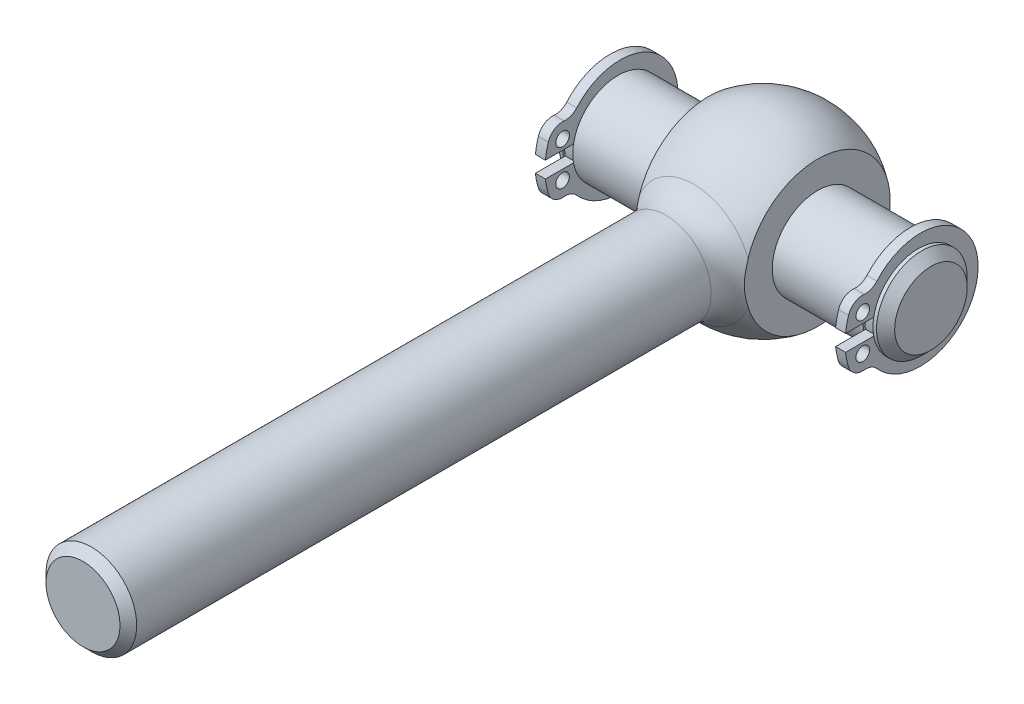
ISO-10303-21;
HEADER;
FILE_DESCRIPTION(('STEP AP214'),'2;1');
FILE_NAME('part.step','',(''),(''),'','','');
FILE_SCHEMA(('AUTOMOTIVE_DESIGN { 1 0 10303 214 1 1 1 1 }'));
ENDSEC;
DATA;
#1=APPLICATION_CONTEXT('core data for automotive mechanical design processes');
#2=APPLICATION_PROTOCOL_DEFINITION('international standard','automotive_design',2000,#1);
#3=PRODUCT_CONTEXT('',#1,'mechanical');
#4=PRODUCT('Part','Part','',(#3));
#5=PRODUCT_RELATED_PRODUCT_CATEGORY('part','',(#4));
#6=PRODUCT_DEFINITION_FORMATION('','',#4);
#7=PRODUCT_DEFINITION_CONTEXT('part definition',#1,'design');
#8=PRODUCT_DEFINITION('design','',#6,#7);
#9=PRODUCT_DEFINITION_SHAPE('','',#8);
#10=(LENGTH_UNIT() NAMED_UNIT(*) SI_UNIT(.MILLI.,.METRE.));
#11=(NAMED_UNIT(*) PLANE_ANGLE_UNIT() SI_UNIT($,.RADIAN.));
#12=(NAMED_UNIT(*) SI_UNIT($,.STERADIAN.) SOLID_ANGLE_UNIT());
#13=UNCERTAINTY_MEASURE_WITH_UNIT(LENGTH_MEASURE(1.E-05),#10,'distance_accuracy_value','');
#14=(GEOMETRIC_REPRESENTATION_CONTEXT(3) GLOBAL_UNCERTAINTY_ASSIGNED_CONTEXT((#13)) GLOBAL_UNIT_ASSIGNED_CONTEXT((#10,
#11,#12)) REPRESENTATION_CONTEXT('',''));
#15=CARTESIAN_POINT('',(0.,0.,0.));
#16=DIRECTION('',(0.,0.,1.));
#17=DIRECTION('',(1.,0.,0.));
#18=AXIS2_PLACEMENT_3D('',#15,#16,#17);
#19=CARTESIAN_POINT('',(-18.5,0.,0.));
#20=DIRECTION('',(-1.,0.,0.));
#21=DIRECTION('',(0.,1.,0.));
#22=AXIS2_PLACEMENT_3D('',#19,#20,#21);
#23=PLANE('',#22);
#24=CARTESIAN_POINT('',(-18.5,0.,0.));
#25=DIRECTION('',(-1.,0.,0.));
#26=DIRECTION('',(0.,1.,0.));
#27=AXIS2_PLACEMENT_3D('',#24,#25,#26);
#28=CIRCLE('',#27,4.);
#29=CARTESIAN_POINT('',(-18.5,4.00000000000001,0.));
#30=VERTEX_POINT('',#29);
#31=EDGE_CURVE('E459',#30,#30,#28,.T.);
#32=ORIENTED_EDGE('',*,*,#31,.T.);
#33=EDGE_LOOP('',(#32));
#34=FACE_BOUND('',#33,.T.);
#35=ADVANCED_FACE('F14',(#34),#23,.T.);
#36=CARTESIAN_POINT('',(-18.5,0.,0.));
#37=DIRECTION('',(1.,0.,0.));
#38=DIRECTION('',(0.,-1.,0.));
#39=AXIS2_PLACEMENT_3D('',#36,#37,#38);
#40=CONICAL_SURFACE('',#39,4.,0.785398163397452);
#41=CARTESIAN_POINT('',(-17.5,0.,0.));
#42=DIRECTION('',(-1.,0.,0.));
#43=DIRECTION('',(0.,1.,0.));
#44=AXIS2_PLACEMENT_3D('',#41,#42,#43);
#45=CIRCLE('',#44,5.);
#46=CARTESIAN_POINT('',(-17.5,5.00000000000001,0.));
#47=VERTEX_POINT('',#46);
#48=EDGE_CURVE('E456',#47,#47,#45,.T.);
#49=ORIENTED_EDGE('',*,*,#48,.T.);
#50=EDGE_LOOP('',(#49));
#51=FACE_BOUND('',#50,.T.);
#52=ORIENTED_EDGE('',*,*,#31,.F.);
#53=EDGE_LOOP('',(#52));
#54=FACE_BOUND('',#53,.T.);
#55=ADVANCED_FACE('F544',(#51,#54),#40,.T.);
#56=CARTESIAN_POINT('',(18.5,0.,0.));
#57=DIRECTION('',(-1.,0.,0.));
#58=DIRECTION('',(0.,1.,0.));
#59=AXIS2_PLACEMENT_3D('',#56,#57,#58);
#60=CYLINDRICAL_SURFACE('',#59,4.8);
#61=CARTESIAN_POINT('',(-16.,0.,0.));
#62=DIRECTION('',(-1.,0.,0.));
#63=DIRECTION('',(0.,1.,0.));
#64=AXIS2_PLACEMENT_3D('',#61,#62,#63);
#65=CIRCLE('',#64,4.8);
#66=CARTESIAN_POINT('',(-16.,-0.900001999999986,4.71486971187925));
#67=VERTEX_POINT('',#66);
#68=CARTESIAN_POINT('',(-16.,0.900002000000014,4.71486971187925));
#69=VERTEX_POINT('',#68);
#70=EDGE_CURVE('E447',#67,#69,#65,.T.);
#71=ORIENTED_EDGE('',*,*,#70,.T.);
#72=DIRECTION('',(-1.,0.,0.));
#73=VECTOR('',#72,1.);
#74=CARTESIAN_POINT('',(18.5,0.900002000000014,4.71486971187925));
#75=LINE('',#74,#73);
#76=CARTESIAN_POINT('',(-17.1,0.900002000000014,4.71486971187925));
#77=VERTEX_POINT('',#76);
#78=EDGE_CURVE('E33',#77,#69,#75,.F.);
#79=ORIENTED_EDGE('',*,*,#78,.F.);
#80=CARTESIAN_POINT('',(-17.1,0.,0.));
#81=DIRECTION('',(-1.,0.,0.));
#82=DIRECTION('',(0.,1.,0.));
#83=AXIS2_PLACEMENT_3D('',#80,#81,#82);
#84=CIRCLE('',#83,4.8);
#85=CARTESIAN_POINT('',(-17.1,-0.900001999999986,4.71486971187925));
#86=VERTEX_POINT('',#85);
#87=EDGE_CURVE('E450',#86,#77,#84,.T.);
#88=ORIENTED_EDGE('',*,*,#87,.F.);
#89=DIRECTION('',(-1.,0.,0.));
#90=VECTOR('',#89,1.);
#91=CARTESIAN_POINT('',(18.5,-0.900001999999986,4.71486971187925));
#92=LINE('',#91,#90);
#93=EDGE_CURVE('E470',#67,#86,#92,.T.);
#94=ORIENTED_EDGE('',*,*,#93,.F.);
#95=EDGE_LOOP('',(#71,#79,#88,#94));
#96=FACE_BOUND('',#95,.T.);
#97=ADVANCED_FACE('F550',(#96),#60,.T.);
#98=CARTESIAN_POINT('',(-17.1,0.,-5.));
#99=DIRECTION('',(1.,0.,0.));
#100=DIRECTION('',(0.,-1.,0.));
#101=AXIS2_PLACEMENT_3D('',#98,#99,#100);
#102=PLANE('',#101);
#103=DIRECTION('',(0.,0.,-1.));
#104=VECTOR('',#103,1.);
#105=CARTESIAN_POINT('',(-17.1,0.900002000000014,-5.));
#106=LINE('',#105,#104);
#107=CARTESIAN_POINT('',(-17.1,0.900002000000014,4.91833268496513));
#108=VERTEX_POINT('',#107);
#109=EDGE_CURVE('E325',#108,#77,#106,.T.);
#110=ORIENTED_EDGE('',*,*,#109,.F.);
#111=CARTESIAN_POINT('',(-17.1,0.,0.));
#112=DIRECTION('',(-1.,0.,0.));
#113=DIRECTION('',(0.,1.,0.));
#114=AXIS2_PLACEMENT_3D('',#111,#112,#113);
#115=CIRCLE('',#114,5.);
#116=CARTESIAN_POINT('',(-17.1,-0.900001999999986,4.91833268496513));
#117=VERTEX_POINT('',#116);
#118=EDGE_CURVE('E453',#117,#108,#115,.T.);
#119=ORIENTED_EDGE('',*,*,#118,.F.);
#120=DIRECTION('',(0.,0.,1.));
#121=VECTOR('',#120,1.);
#122=CARTESIAN_POINT('',(-17.1,-0.900001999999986,-5.));
#123=LINE('',#122,#121);
#124=EDGE_CURVE('E321',#86,#117,#123,.T.);
#125=ORIENTED_EDGE('',*,*,#124,.F.);
#126=ORIENTED_EDGE('',*,*,#87,.T.);
#127=EDGE_LOOP('',(#110,#119,#125,#126));
#128=FACE_BOUND('',#127,.T.);
#129=ADVANCED_FACE('F558',(#128),#102,.T.);
#130=CARTESIAN_POINT('',(18.5,0.,0.));
#131=DIRECTION('',(-1.,0.,0.));
#132=DIRECTION('',(0.,1.,0.));
#133=AXIS2_PLACEMENT_3D('',#130,#131,#132);
#134=CYLINDRICAL_SURFACE('',#133,5.);
#135=DIRECTION('',(-1.,0.,0.));
#136=VECTOR('',#135,1.);
#137=CARTESIAN_POINT('',(18.5,0.900002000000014,4.91833268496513));
#138=LINE('',#137,#136);
#139=CARTESIAN_POINT('',(-17.101,0.900002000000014,4.91833268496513));
#140=VERTEX_POINT('',#139);
#141=EDGE_CURVE('E327',#140,#108,#138,.F.);
#142=ORIENTED_EDGE('',*,*,#141,.F.);
#143=CARTESIAN_POINT('',(-17.101,0.,0.));
#144=DIRECTION('',(-1.,0.,0.));
#145=DIRECTION('',(0.,0.,1.));
#146=AXIS2_PLACEMENT_3D('',#143,#144,#145);
#147=CIRCLE('',#146,5.);
#148=CARTESIAN_POINT('',(-17.101,-0.900001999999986,4.91833268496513));
#149=VERTEX_POINT('',#148);
#150=EDGE_CURVE('E234',#149,#140,#147,.F.);
#151=ORIENTED_EDGE('',*,*,#150,.F.);
#152=DIRECTION('',(-1.,0.,0.));
#153=VECTOR('',#152,1.);
#154=CARTESIAN_POINT('',(18.5,-0.900001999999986,4.91833268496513));
#155=LINE('',#154,#153);
#156=EDGE_CURVE('E323',#117,#149,#155,.T.);
#157=ORIENTED_EDGE('',*,*,#156,.F.);
#158=ORIENTED_EDGE('',*,*,#118,.T.);
#159=EDGE_LOOP('',(#142,#151,#157,#158));
#160=FACE_BOUND('',#159,.T.);
#161=ORIENTED_EDGE('',*,*,#48,.F.);
#162=EDGE_LOOP('',(#161));
#163=FACE_BOUND('',#162,.T.);
#164=ADVANCED_FACE('F554',(#160,#163),#134,.T.);
#165=CARTESIAN_POINT('',(-17.101,-5.24923653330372,5.80103299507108));
#166=DIRECTION('',(-1.,0.,0.));
#167=DIRECTION('',(0.,0.,1.));
#168=AXIS2_PLACEMENT_3D('',#165,#166,#167);
#169=PLANE('',#168);
#170=CARTESIAN_POINT('',(-17.101,-1.9786,6.12));
#171=DIRECTION('',(1.,0.,0.));
#172=DIRECTION('',(0.,0.,-1.));
#173=AXIS2_PLACEMENT_3D('',#170,#171,#172);
#174=CIRCLE('',#173,0.75);
#175=CARTESIAN_POINT('',(-17.101,-1.9786,5.37));
#176=VERTEX_POINT('',#175);
#177=EDGE_CURVE('E299',#176,#176,#174,.T.);
#178=ORIENTED_EDGE('',*,*,#177,.T.);
#179=EDGE_LOOP('',(#178));
#180=FACE_BOUND('',#179,.T.);
#181=DIRECTION('',(0.,0.,1.));
#182=VECTOR('',#181,1.);
#183=CARTESIAN_POINT('',(-17.101,-0.900001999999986,3.89743459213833));
#184=LINE('',#183,#182);
#185=CARTESIAN_POINT('',(-17.101,-0.900001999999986,8.01489796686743));
#186=VERTEX_POINT('',#185);
#187=EDGE_CURVE('E291',#149,#186,#184,.T.);
#188=ORIENTED_EDGE('',*,*,#187,.F.);
#189=ORIENTED_EDGE('',*,*,#150,.T.);
#190=DIRECTION('',(0.,0.,-1.));
#191=VECTOR('',#190,1.);
#192=CARTESIAN_POINT('',(-17.101,0.900002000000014,8.01490802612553));
#193=LINE('',#192,#191);
#194=CARTESIAN_POINT('',(-17.101,0.900002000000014,8.01490802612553));
#195=VERTEX_POINT('',#194);
#196=EDGE_CURVE('E289',#195,#140,#193,.T.);
#197=ORIENTED_EDGE('',*,*,#196,.F.);
#198=CARTESIAN_POINT('',(-17.101,-0.000166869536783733,-0.241060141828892));
#199=DIRECTION('',(1.,0.,0.));
#200=DIRECTION('',(0.,0.,-1.));
#201=AXIS2_PLACEMENT_3D('',#198,#199,#200);
#202=CIRCLE('',#201,8.30489701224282);
#203=CARTESIAN_POINT('',(-17.101,2.46671555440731,7.68899695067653));
#204=VERTEX_POINT('',#203);
#205=EDGE_CURVE('E286',#204,#195,#202,.T.);
#206=ORIENTED_EDGE('',*,*,#205,.F.);
#207=CARTESIAN_POINT('',(-17.101,1.97848490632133,6.11997131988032));
#208=DIRECTION('',(1.,0.,0.));
#209=DIRECTION('',(0.,0.,-1.));
#210=AXIS2_PLACEMENT_3D('',#207,#208,#209);
#211=CIRCLE('',#210,1.64323175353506);
#212=CARTESIAN_POINT('',(-17.101,3.61390769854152,5.95996229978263));
#213=VERTEX_POINT('',#212);
#214=EDGE_CURVE('E283',#213,#204,#211,.T.);
#215=ORIENTED_EDGE('',*,*,#214,.F.);
#216=CARTESIAN_POINT('',(-17.101,5.24933117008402,5.8011001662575));
#217=DIRECTION('',(-1.,0.,0.));
#218=DIRECTION('',(0.,0.,-1.));
#219=AXIS2_PLACEMENT_3D('',#216,#217,#218);
#220=CIRCLE('',#219,1.6431211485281);
#221=CARTESIAN_POINT('',(-17.101,4.17159434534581,4.56080566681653));
#222=VERTEX_POINT('',#221);
#223=EDGE_CURVE('E280',#222,#213,#220,.T.);
#224=ORIENTED_EDGE('',*,*,#223,.F.);
#225=CARTESIAN_POINT('',(-17.101,0.,-0.240004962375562));
#226=DIRECTION('',(1.,0.,0.));
#227=DIRECTION('',(0.,0.,1.));
#228=AXIS2_PLACEMENT_3D('',#225,#226,#227);
#229=CIRCLE('',#228,6.36003003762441);
#230=CARTESIAN_POINT('',(-17.101,-4.17159434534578,4.56080566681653));
#231=VERTEX_POINT('',#230);
#232=EDGE_CURVE('E277',#231,#222,#229,.T.);
#233=ORIENTED_EDGE('',*,*,#232,.F.);
#234=CARTESIAN_POINT('',(-17.101,-5.24923653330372,5.80103299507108));
#235=DIRECTION('',(-1.,0.,0.));
#236=DIRECTION('',(0.,0.,-1.));
#237=AXIS2_PLACEMENT_3D('',#234,#235,#236);
#238=CIRCLE('',#237,1.64300837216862);
#239=CARTESIAN_POINT('',(-17.101,-3.61398958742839,5.96054455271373));
#240=VERTEX_POINT('',#239);
#241=EDGE_CURVE('E276',#240,#231,#238,.T.);
#242=ORIENTED_EDGE('',*,*,#241,.F.);
#243=CARTESIAN_POINT('',(-17.101,-1.97865825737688,6.12005314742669));
#244=DIRECTION('',(1.,0.,0.));
#245=DIRECTION('',(0.,0.,-1.));
#246=AXIS2_PLACEMENT_3D('',#243,#244,#245);
#247=CIRCLE('',#246,1.64309207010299);
#248=CARTESIAN_POINT('',(-17.101,-2.46670177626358,7.68899070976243));
#249=VERTEX_POINT('',#248);
#250=EDGE_CURVE('E296',#249,#240,#247,.T.);
#251=ORIENTED_EDGE('',*,*,#250,.F.);
#252=CARTESIAN_POINT('',(-17.101,0.000165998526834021,-0.241054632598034));
#253=DIRECTION('',(1.,0.,0.));
#254=DIRECTION('',(0.,0.,-1.));
#255=AXIS2_PLACEMENT_3D('',#252,#253,#254);
#256=CIRCLE('',#255,8.30488144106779);
#257=EDGE_CURVE('E293',#186,#249,#256,.T.);
#258=ORIENTED_EDGE('',*,*,#257,.F.);
#259=EDGE_LOOP('',(#188,#189,#197,#206,#215,#224,#233,#242,#251,#258));
#260=FACE_BOUND('',#259,.T.);
#261=CARTESIAN_POINT('',(-17.101,1.9786,6.12));
#262=DIRECTION('',(1.,0.,0.));
#263=DIRECTION('',(0.,0.,-1.));
#264=AXIS2_PLACEMENT_3D('',#261,#262,#263);
#265=CIRCLE('',#264,0.75);
#266=CARTESIAN_POINT('',(-17.101,1.9786,5.37));
#267=VERTEX_POINT('',#266);
#268=EDGE_CURVE('E303',#267,#267,#265,.T.);
#269=ORIENTED_EDGE('',*,*,#268,.T.);
#270=EDGE_LOOP('',(#269));
#271=FACE_BOUND('',#270,.T.);
#272=ADVANCED_FACE('F557',(#180,#260,#271),#169,.T.);
#273=CARTESIAN_POINT('',(-17.101,1.9786,6.12));
#274=DIRECTION('',(1.,0.,0.));
#275=DIRECTION('',(0.,-1.,0.));
#276=AXIS2_PLACEMENT_3D('',#273,#274,#275);
#277=CYLINDRICAL_SURFACE('',#276,0.75);
#278=ORIENTED_EDGE('',*,*,#268,.F.);
#279=EDGE_LOOP('',(#278));
#280=FACE_BOUND('',#279,.T.);
#281=CARTESIAN_POINT('',(-15.999,1.9786,6.12));
#282=DIRECTION('',(1.,0.,0.));
#283=DIRECTION('',(0.,0.,-1.));
#284=AXIS2_PLACEMENT_3D('',#281,#282,#283);
#285=CIRCLE('',#284,0.75);
#286=CARTESIAN_POINT('',(-15.999,1.9786,5.37));
#287=VERTEX_POINT('',#286);
#288=EDGE_CURVE('E270',#287,#287,#285,.T.);
#289=ORIENTED_EDGE('',*,*,#288,.T.);
#290=EDGE_LOOP('',(#289));
#291=FACE_BOUND('',#290,.T.);
#292=ADVANCED_FACE('F685',(#280,#291),#277,.F.);
#293=CARTESIAN_POINT('',(-17.101,-1.9786,6.12));
#294=DIRECTION('',(1.,0.,0.));
#295=DIRECTION('',(0.,-1.,0.));
#296=AXIS2_PLACEMENT_3D('',#293,#294,#295);
#297=CYLINDRICAL_SURFACE('',#296,0.75);
#298=ORIENTED_EDGE('',*,*,#177,.F.);
#299=EDGE_LOOP('',(#298));
#300=FACE_BOUND('',#299,.T.);
#301=CARTESIAN_POINT('',(-15.999,-1.9786,6.12));
#302=DIRECTION('',(1.,0.,0.));
#303=DIRECTION('',(0.,0.,-1.));
#304=AXIS2_PLACEMENT_3D('',#301,#302,#303);
#305=CIRCLE('',#304,0.75);
#306=CARTESIAN_POINT('',(-15.999,-1.9786,5.37));
#307=VERTEX_POINT('',#306);
#308=EDGE_CURVE('E262',#307,#307,#305,.T.);
#309=ORIENTED_EDGE('',*,*,#308,.T.);
#310=EDGE_LOOP('',(#309));
#311=FACE_BOUND('',#310,.T.);
#312=ADVANCED_FACE('F669',(#300,#311),#297,.F.);
#313=CARTESIAN_POINT('',(-17.101,-0.000166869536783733,-0.241060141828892));
#314=DIRECTION('',(1.,0.,0.));
#315=DIRECTION('',(0.,-1.,0.));
#316=AXIS2_PLACEMENT_3D('',#313,#314,#315);
#317=CYLINDRICAL_SURFACE('',#316,8.30489701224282);
#318=DIRECTION('',(1.,0.,0.));
#319=VECTOR('',#318,1.);
#320=CARTESIAN_POINT('',(-17.101,0.900002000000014,8.01490802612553));
#321=LINE('',#320,#319);
#322=CARTESIAN_POINT('',(-15.999,0.900002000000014,8.01490802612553));
#323=VERTEX_POINT('',#322);
#324=EDGE_CURVE('E312',#195,#323,#321,.T.);
#325=ORIENTED_EDGE('',*,*,#324,.T.);
#326=CARTESIAN_POINT('',(-15.999,-0.000166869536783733,-0.241060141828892));
#327=DIRECTION('',(1.,0.,0.));
#328=DIRECTION('',(0.,0.,-1.));
#329=AXIS2_PLACEMENT_3D('',#326,#327,#328);
#330=CIRCLE('',#329,8.30489701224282);
#331=CARTESIAN_POINT('',(-15.999,2.46671555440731,7.68899695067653));
#332=VERTEX_POINT('',#331);
#333=EDGE_CURVE('E248',#332,#323,#330,.T.);
#334=ORIENTED_EDGE('',*,*,#333,.F.);
#335=DIRECTION('',(1.,0.,0.));
#336=VECTOR('',#335,1.);
#337=CARTESIAN_POINT('',(-17.101,2.46671555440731,7.68899695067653));
#338=LINE('',#337,#336);
#339=EDGE_CURVE('E314',#204,#332,#338,.T.);
#340=ORIENTED_EDGE('',*,*,#339,.F.);
#341=ORIENTED_EDGE('',*,*,#205,.T.);
#342=EDGE_LOOP('',(#325,#334,#340,#341));
#343=FACE_BOUND('',#342,.T.);
#344=ADVANCED_FACE('F665',(#343),#317,.T.);
#345=CARTESIAN_POINT('',(-17.101,1.97848490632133,6.11997131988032));
#346=DIRECTION('',(1.,0.,0.));
#347=DIRECTION('',(0.,-1.,0.));
#348=AXIS2_PLACEMENT_3D('',#345,#346,#347);
#349=CYLINDRICAL_SURFACE('',#348,1.64323175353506);
#350=ORIENTED_EDGE('',*,*,#339,.T.);
#351=CARTESIAN_POINT('',(-15.999,1.97848490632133,6.11997131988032));
#352=DIRECTION('',(1.,0.,0.));
#353=DIRECTION('',(0.,0.,-1.));
#354=AXIS2_PLACEMENT_3D('',#351,#352,#353);
#355=CIRCLE('',#354,1.64323175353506);
#356=CARTESIAN_POINT('',(-15.999,3.61390769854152,5.95996229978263));
#357=VERTEX_POINT('',#356);
#358=EDGE_CURVE('E253',#357,#332,#355,.T.);
#359=ORIENTED_EDGE('',*,*,#358,.F.);
#360=DIRECTION('',(1.,0.,0.));
#361=VECTOR('',#360,1.);
#362=CARTESIAN_POINT('',(-17.101,3.61390769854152,5.95996229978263));
#363=LINE('',#362,#361);
#364=EDGE_CURVE('E316',#213,#357,#363,.T.);
#365=ORIENTED_EDGE('',*,*,#364,.F.);
#366=ORIENTED_EDGE('',*,*,#214,.T.);
#367=EDGE_LOOP('',(#350,#359,#365,#366));
#368=FACE_BOUND('',#367,.T.);
#369=ADVANCED_FACE('F661',(#368),#349,.T.);
#370=CARTESIAN_POINT('',(-17.101,5.24933117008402,5.8011001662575));
#371=DIRECTION('',(1.,0.,0.));
#372=DIRECTION('',(0.,-1.,0.));
#373=AXIS2_PLACEMENT_3D('',#370,#371,#372);
#374=CYLINDRICAL_SURFACE('',#373,1.6431211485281);
#375=ORIENTED_EDGE('',*,*,#364,.T.);
#376=CARTESIAN_POINT('',(-15.999,5.24933117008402,5.8011001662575));
#377=DIRECTION('',(-1.,0.,0.));
#378=DIRECTION('',(0.,0.,-1.));
#379=AXIS2_PLACEMENT_3D('',#376,#377,#378);
#380=CIRCLE('',#379,1.6431211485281);
#381=CARTESIAN_POINT('',(-15.999,4.17159434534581,4.56080566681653));
#382=VERTEX_POINT('',#381);
#383=EDGE_CURVE('E1498',#382,#357,#380,.T.);
#384=ORIENTED_EDGE('',*,*,#383,.F.);
#385=DIRECTION('',(1.,0.,0.));
#386=VECTOR('',#385,1.);
#387=CARTESIAN_POINT('',(-17.101,4.17159434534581,4.56080566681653));
#388=LINE('',#387,#386);
#389=EDGE_CURVE('E318',#222,#382,#388,.T.);
#390=ORIENTED_EDGE('',*,*,#389,.F.);
#391=ORIENTED_EDGE('',*,*,#223,.T.);
#392=EDGE_LOOP('',(#375,#384,#390,#391));
#393=FACE_BOUND('',#392,.T.);
#394=ADVANCED_FACE('F657',(#393),#374,.F.);
#395=CARTESIAN_POINT('',(-17.101,0.,-0.240004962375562));
#396=DIRECTION('',(1.,0.,0.));
#397=DIRECTION('',(0.,-1.,0.));
#398=AXIS2_PLACEMENT_3D('',#395,#396,#397);
#399=CYLINDRICAL_SURFACE('',#398,6.36003003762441);
#400=ORIENTED_EDGE('',*,*,#389,.T.);
#401=CARTESIAN_POINT('',(-15.999,0.,-0.240004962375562));
#402=DIRECTION('',(1.,0.,0.));
#403=DIRECTION('',(0.,0.,1.));
#404=AXIS2_PLACEMENT_3D('',#401,#402,#403);
#405=CIRCLE('',#404,6.36003003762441);
#406=CARTESIAN_POINT('',(-15.999,-4.17159434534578,4.56080566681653));
#407=VERTEX_POINT('',#406);
#408=EDGE_CURVE('E266',#407,#382,#405,.T.);
#409=ORIENTED_EDGE('',*,*,#408,.F.);
#410=DIRECTION('',(1.,0.,0.));
#411=VECTOR('',#410,1.);
#412=CARTESIAN_POINT('',(-17.101,-4.17159434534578,4.56080566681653));
#413=LINE('',#412,#411);
#414=EDGE_CURVE('E64',#231,#407,#413,.T.);
#415=ORIENTED_EDGE('',*,*,#414,.F.);
#416=ORIENTED_EDGE('',*,*,#232,.T.);
#417=EDGE_LOOP('',(#400,#409,#415,#416));
#418=FACE_BOUND('',#417,.T.);
#419=ADVANCED_FACE('F654',(#418),#399,.T.);
#420=CARTESIAN_POINT('',(-17.101,-5.24923653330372,5.80103299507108));
#421=DIRECTION('',(1.,0.,0.));
#422=DIRECTION('',(0.,-1.,0.));
#423=AXIS2_PLACEMENT_3D('',#420,#421,#422);
#424=CYLINDRICAL_SURFACE('',#423,1.64300837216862);
#425=ORIENTED_EDGE('',*,*,#414,.T.);
#426=CARTESIAN_POINT('',(-15.999,-5.24923653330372,5.80103299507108));
#427=DIRECTION('',(-1.,0.,0.));
#428=DIRECTION('',(0.,0.,-1.));
#429=AXIS2_PLACEMENT_3D('',#426,#427,#428);
#430=CIRCLE('',#429,1.64300837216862);
#431=CARTESIAN_POINT('',(-15.999,-3.61398958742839,5.96054455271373));
#432=VERTEX_POINT('',#431);
#433=EDGE_CURVE('E263',#432,#407,#430,.T.);
#434=ORIENTED_EDGE('',*,*,#433,.F.);
#435=DIRECTION('',(1.,0.,0.));
#436=VECTOR('',#435,1.);
#437=CARTESIAN_POINT('',(-17.101,-3.61398958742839,5.96054455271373));
#438=LINE('',#437,#436);
#439=EDGE_CURVE('E306',#240,#432,#438,.T.);
#440=ORIENTED_EDGE('',*,*,#439,.F.);
#441=ORIENTED_EDGE('',*,*,#241,.T.);
#442=EDGE_LOOP('',(#425,#434,#440,#441));
#443=FACE_BOUND('',#442,.T.);
#444=ADVANCED_FACE('F650',(#443),#424,.F.);
#445=CARTESIAN_POINT('',(-17.101,-1.97865825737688,6.12005314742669));
#446=DIRECTION('',(1.,0.,0.));
#447=DIRECTION('',(0.,-1.,0.));
#448=AXIS2_PLACEMENT_3D('',#445,#446,#447);
#449=CYLINDRICAL_SURFACE('',#448,1.64309207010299);
#450=ORIENTED_EDGE('',*,*,#439,.T.);
#451=CARTESIAN_POINT('',(-15.999,-1.97865825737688,6.12005314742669));
#452=DIRECTION('',(1.,0.,0.));
#453=DIRECTION('',(0.,0.,-1.));
#454=AXIS2_PLACEMENT_3D('',#451,#452,#453);
#455=CIRCLE('',#454,1.64309207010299);
#456=CARTESIAN_POINT('',(-15.999,-2.46670177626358,7.68899070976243));
#457=VERTEX_POINT('',#456);
#458=EDGE_CURVE('E259',#457,#432,#455,.T.);
#459=ORIENTED_EDGE('',*,*,#458,.F.);
#460=DIRECTION('',(1.,0.,0.));
#461=VECTOR('',#460,1.);
#462=CARTESIAN_POINT('',(-17.101,-2.46670177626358,7.68899070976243));
#463=LINE('',#462,#461);
#464=EDGE_CURVE('E308',#249,#457,#463,.T.);
#465=ORIENTED_EDGE('',*,*,#464,.F.);
#466=ORIENTED_EDGE('',*,*,#250,.T.);
#467=EDGE_LOOP('',(#450,#459,#465,#466));
#468=FACE_BOUND('',#467,.T.);
#469=ADVANCED_FACE('F653',(#468),#449,.T.);
#470=CARTESIAN_POINT('',(-17.101,0.000165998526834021,-0.241054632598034));
#471=DIRECTION('',(1.,0.,0.));
#472=DIRECTION('',(0.,-1.,0.));
#473=AXIS2_PLACEMENT_3D('',#470,#471,#472);
#474=CYLINDRICAL_SURFACE('',#473,8.30488144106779);
#475=ORIENTED_EDGE('',*,*,#464,.T.);
#476=CARTESIAN_POINT('',(-15.999,0.000165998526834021,-0.241054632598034));
#477=DIRECTION('',(1.,0.,0.));
#478=DIRECTION('',(0.,0.,-1.));
#479=AXIS2_PLACEMENT_3D('',#476,#477,#478);
#480=CIRCLE('',#479,8.30488144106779);
#481=CARTESIAN_POINT('',(-15.999,-0.900001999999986,8.01489796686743));
#482=VERTEX_POINT('',#481);
#483=EDGE_CURVE('E251',#482,#457,#480,.T.);
#484=ORIENTED_EDGE('',*,*,#483,.F.);
#485=DIRECTION('',(1.,0.,0.));
#486=VECTOR('',#485,1.);
#487=CARTESIAN_POINT('',(-17.101,-0.900001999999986,8.01489796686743));
#488=LINE('',#487,#486);
#489=EDGE_CURVE('E310',#186,#482,#488,.T.);
#490=ORIENTED_EDGE('',*,*,#489,.F.);
#491=ORIENTED_EDGE('',*,*,#257,.T.);
#492=EDGE_LOOP('',(#475,#484,#490,#491));
#493=FACE_BOUND('',#492,.T.);
#494=ADVANCED_FACE('F675',(#493),#474,.T.);
#495=CARTESIAN_POINT('',(-17.101,-0.900001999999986,3.89743459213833));
#496=DIRECTION('',(0.,1.,0.));
#497=DIRECTION('',(1.,0.,0.));
#498=AXIS2_PLACEMENT_3D('',#495,#496,#497);
#499=PLANE('',#498);
#500=ORIENTED_EDGE('',*,*,#124,.T.);
#501=ORIENTED_EDGE('',*,*,#156,.T.);
#502=ORIENTED_EDGE('',*,*,#187,.T.);
#503=ORIENTED_EDGE('',*,*,#489,.T.);
#504=DIRECTION('',(0.,0.,1.));
#505=VECTOR('',#504,1.);
#506=CARTESIAN_POINT('',(-15.999,-0.900001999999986,3.89743459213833));
#507=LINE('',#506,#505);
#508=CARTESIAN_POINT('',(-15.999,-0.900001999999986,4.91833268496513));
#509=VERTEX_POINT('',#508);
#510=EDGE_CURVE('E249',#509,#482,#507,.T.);
#511=ORIENTED_EDGE('',*,*,#510,.F.);
#512=DIRECTION('',(-1.,0.,0.));
#513=VECTOR('',#512,1.);
#514=CARTESIAN_POINT('',(18.5,-0.900001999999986,4.91833268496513));
#515=LINE('',#514,#513);
#516=CARTESIAN_POINT('',(-16.,-0.900001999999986,4.91833268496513));
#517=VERTEX_POINT('',#516);
#518=EDGE_CURVE('E229',#517,#509,#515,.F.);
#519=ORIENTED_EDGE('',*,*,#518,.F.);
#520=DIRECTION('',(0.,0.,1.));
#521=VECTOR('',#520,1.);
#522=CARTESIAN_POINT('',(-16.,-0.900001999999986,-4.8));
#523=LINE('',#522,#521);
#524=EDGE_CURVE('E241',#67,#517,#523,.T.);
#525=ORIENTED_EDGE('',*,*,#524,.F.);
#526=ORIENTED_EDGE('',*,*,#93,.T.);
#527=EDGE_LOOP('',(#500,#501,#502,#503,#511,#519,#525,#526));
#528=FACE_BOUND('',#527,.T.);
#529=ADVANCED_FACE('F569',(#528),#499,.T.);
#530=CARTESIAN_POINT('',(-16.,0.,-4.8));
#531=DIRECTION('',(-1.,0.,0.));
#532=DIRECTION('',(0.,1.,0.));
#533=AXIS2_PLACEMENT_3D('',#530,#531,#532);
#534=PLANE('',#533);
#535=CARTESIAN_POINT('',(-16.,0.,0.));
#536=DIRECTION('',(-1.,0.,0.));
#537=DIRECTION('',(0.,1.,0.));
#538=AXIS2_PLACEMENT_3D('',#535,#536,#537);
#539=CIRCLE('',#538,5.);
#540=CARTESIAN_POINT('',(-16.,0.900002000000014,4.91833268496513));
#541=VERTEX_POINT('',#540);
#542=EDGE_CURVE('E445',#517,#541,#539,.T.);
#543=ORIENTED_EDGE('',*,*,#542,.T.);
#544=DIRECTION('',(0.,0.,-1.));
#545=VECTOR('',#544,1.);
#546=CARTESIAN_POINT('',(-16.,0.900002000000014,-4.8));
#547=LINE('',#546,#545);
#548=EDGE_CURVE('E240',#541,#69,#547,.T.);
#549=ORIENTED_EDGE('',*,*,#548,.T.);
#550=ORIENTED_EDGE('',*,*,#70,.F.);
#551=ORIENTED_EDGE('',*,*,#524,.T.);
#552=EDGE_LOOP('',(#543,#549,#550,#551));
#553=FACE_BOUND('',#552,.T.);
#554=ADVANCED_FACE('F566',(#553),#534,.T.);
#555=CARTESIAN_POINT('',(-17.101,0.900002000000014,8.01490802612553));
#556=DIRECTION('',(0.,-1.,0.));
#557=DIRECTION('',(-1.,0.,0.));
#558=AXIS2_PLACEMENT_3D('',#555,#556,#557);
#559=PLANE('',#558);
#560=ORIENTED_EDGE('',*,*,#196,.T.);
#561=ORIENTED_EDGE('',*,*,#141,.T.);
#562=ORIENTED_EDGE('',*,*,#109,.T.);
#563=ORIENTED_EDGE('',*,*,#78,.T.);
#564=ORIENTED_EDGE('',*,*,#548,.F.);
#565=DIRECTION('',(-1.,0.,0.));
#566=VECTOR('',#565,1.);
#567=CARTESIAN_POINT('',(18.5,0.900002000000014,4.91833268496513));
#568=LINE('',#567,#566);
#569=CARTESIAN_POINT('',(-15.999,0.900002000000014,4.91833268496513));
#570=VERTEX_POINT('',#569);
#571=EDGE_CURVE('E226',#570,#541,#568,.T.);
#572=ORIENTED_EDGE('',*,*,#571,.F.);
#573=DIRECTION('',(0.,0.,-1.));
#574=VECTOR('',#573,1.);
#575=CARTESIAN_POINT('',(-15.999,0.900002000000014,8.01490802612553));
#576=LINE('',#575,#574);
#577=EDGE_CURVE('E239',#323,#570,#576,.T.);
#578=ORIENTED_EDGE('',*,*,#577,.F.);
#579=ORIENTED_EDGE('',*,*,#324,.F.);
#580=EDGE_LOOP('',(#560,#561,#562,#563,#564,#572,#578,#579));
#581=FACE_BOUND('',#580,.T.);
#582=ADVANCED_FACE('F238',(#581),#559,.T.);
#583=CARTESIAN_POINT('',(-15.999,-5.24923653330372,5.80103299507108));
#584=DIRECTION('',(-1.,0.,0.));
#585=DIRECTION('',(0.,0.,1.));
#586=AXIS2_PLACEMENT_3D('',#583,#584,#585);
#587=PLANE('',#586);
#588=CARTESIAN_POINT('',(-15.999,0.,0.));
#589=DIRECTION('',(-1.,0.,0.));
#590=DIRECTION('',(0.,0.,1.));
#591=AXIS2_PLACEMENT_3D('',#588,#589,#590);
#592=CIRCLE('',#591,5.);
#593=EDGE_CURVE('E222',#509,#570,#592,.F.);
#594=ORIENTED_EDGE('',*,*,#593,.F.);
#595=ORIENTED_EDGE('',*,*,#510,.T.);
#596=ORIENTED_EDGE('',*,*,#483,.T.);
#597=ORIENTED_EDGE('',*,*,#458,.T.);
#598=ORIENTED_EDGE('',*,*,#433,.T.);
#599=ORIENTED_EDGE('',*,*,#408,.T.);
#600=ORIENTED_EDGE('',*,*,#383,.T.);
#601=ORIENTED_EDGE('',*,*,#358,.T.);
#602=ORIENTED_EDGE('',*,*,#333,.T.);
#603=ORIENTED_EDGE('',*,*,#577,.T.);
#604=EDGE_LOOP('',(#594,#595,#596,#597,#598,#599,#600,#601,#602,#603));
#605=FACE_BOUND('',#604,.T.);
#606=ORIENTED_EDGE('',*,*,#308,.F.);
#607=EDGE_LOOP('',(#606));
#608=FACE_BOUND('',#607,.T.);
#609=ORIENTED_EDGE('',*,*,#288,.F.);
#610=EDGE_LOOP('',(#609));
#611=FACE_BOUND('',#610,.T.);
#612=ADVANCED_FACE('F244',(#605,#608,#611),#587,.F.);
#613=CARTESIAN_POINT('',(18.5,0.,0.));
#614=DIRECTION('',(-1.,0.,0.));
#615=DIRECTION('',(0.,1.,0.));
#616=AXIS2_PLACEMENT_3D('',#613,#614,#615);
#617=CYLINDRICAL_SURFACE('',#616,5.);
#618=CARTESIAN_POINT('',(-6.,0.,0.));
#619=DIRECTION('',(1.,0.,0.));
#620=DIRECTION('',(0.,0.,-1.));
#621=AXIS2_PLACEMENT_3D('',#618,#619,#620);
#622=CIRCLE('',#621,5.);
#623=CARTESIAN_POINT('',(-6.,0.,-4.99999999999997));
#624=VERTEX_POINT('',#623);
#625=EDGE_CURVE('E18',#624,#624,#622,.T.);
#626=ORIENTED_EDGE('',*,*,#625,.F.);
#627=EDGE_LOOP('',(#626));
#628=FACE_BOUND('',#627,.T.);
#629=ORIENTED_EDGE('',*,*,#593,.T.);
#630=ORIENTED_EDGE('',*,*,#571,.T.);
#631=ORIENTED_EDGE('',*,*,#542,.F.);
#632=ORIENTED_EDGE('',*,*,#518,.T.);
#633=EDGE_LOOP('',(#629,#630,#631,#632));
#634=FACE_BOUND('',#633,.T.);
#635=ADVANCED_FACE('F224',(#628,#634),#617,.T.);
#636=DIRECTION('',(-1.,0.,0.));
#637=VECTOR('',#636,1.);
#638=CARTESIAN_POINT('',(18.5,0.900002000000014,4.91833268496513));
#639=LINE('',#638,#637);
#640=CARTESIAN_POINT('',(15.999,0.900002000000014,4.91833268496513));
#641=VERTEX_POINT('',#640);
#642=CARTESIAN_POINT('',(16.,0.900002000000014,4.91833268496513));
#643=VERTEX_POINT('',#642);
#644=EDGE_CURVE('E425',#641,#643,#639,.F.);
#645=ORIENTED_EDGE('',*,*,#644,.F.);
#646=CARTESIAN_POINT('',(15.999,0.,0.));
#647=DIRECTION('',(-1.,0.,0.));
#648=DIRECTION('',(0.,0.,1.));
#649=AXIS2_PLACEMENT_3D('',#646,#647,#648);
#650=CIRCLE('',#649,5.);
#651=CARTESIAN_POINT('',(15.999,-0.900001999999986,4.91833268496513));
#652=VERTEX_POINT('',#651);
#653=EDGE_CURVE('E466',#652,#641,#650,.F.);
#654=ORIENTED_EDGE('',*,*,#653,.F.);
#655=DIRECTION('',(-1.,0.,0.));
#656=VECTOR('',#655,1.);
#657=CARTESIAN_POINT('',(18.5,-0.900001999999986,4.91833268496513));
#658=LINE('',#657,#656);
#659=CARTESIAN_POINT('',(16.,-0.900001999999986,4.91833268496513));
#660=VERTEX_POINT('',#659);
#661=EDGE_CURVE('E421',#660,#652,#658,.T.);
#662=ORIENTED_EDGE('',*,*,#661,.F.);
#663=CARTESIAN_POINT('',(16.,0.,0.));
#664=DIRECTION('',(-1.,0.,0.));
#665=DIRECTION('',(0.,1.,0.));
#666=AXIS2_PLACEMENT_3D('',#663,#664,#665);
#667=CIRCLE('',#666,5.);
#668=EDGE_CURVE('E442',#660,#643,#667,.T.);
#669=ORIENTED_EDGE('',*,*,#668,.T.);
#670=EDGE_LOOP('',(#645,#654,#662,#669));
#671=FACE_BOUND('',#670,.T.);
#672=CARTESIAN_POINT('',(6.,0.,0.));
#673=DIRECTION('',(1.,0.,0.));
#674=DIRECTION('',(0.,0.,1.));
#675=AXIS2_PLACEMENT_3D('',#672,#673,#674);
#676=CIRCLE('',#675,5.);
#677=CARTESIAN_POINT('',(6.,0.,5.00000000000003));
#678=VERTEX_POINT('',#677);
#679=EDGE_CURVE('E9',#678,#678,#676,.T.);
#680=ORIENTED_EDGE('',*,*,#679,.T.);
#681=EDGE_LOOP('',(#680));
#682=FACE_BOUND('',#681,.T.);
#683=ADVANCED_FACE('F573',(#671,#682),#617,.T.);
#684=CARTESIAN_POINT('',(18.5,0.,0.));
#685=DIRECTION('',(-1.,0.,0.));
#686=DIRECTION('',(0.,1.,0.));
#687=AXIS2_PLACEMENT_3D('',#684,#685,#686);
#688=CYLINDRICAL_SURFACE('',#687,4.8);
#689=CARTESIAN_POINT('',(17.1,0.,0.));
#690=DIRECTION('',(-1.,0.,0.));
#691=DIRECTION('',(0.,1.,0.));
#692=AXIS2_PLACEMENT_3D('',#689,#690,#691);
#693=CIRCLE('',#692,4.8);
#694=CARTESIAN_POINT('',(17.1,-0.900001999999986,4.71486971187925));
#695=VERTEX_POINT('',#694);
#696=CARTESIAN_POINT('',(17.1,0.900002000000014,4.71486971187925));
#697=VERTEX_POINT('',#696);
#698=EDGE_CURVE('E436',#695,#697,#693,.T.);
#699=ORIENTED_EDGE('',*,*,#698,.T.);
#700=DIRECTION('',(-1.,0.,0.));
#701=VECTOR('',#700,1.);
#702=CARTESIAN_POINT('',(18.5,0.900002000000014,4.71486971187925));
#703=LINE('',#702,#701);
#704=CARTESIAN_POINT('',(16.,0.900002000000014,4.71486971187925));
#705=VERTEX_POINT('',#704);
#706=EDGE_CURVE('E464',#705,#697,#703,.F.);
#707=ORIENTED_EDGE('',*,*,#706,.F.);
#708=CARTESIAN_POINT('',(16.,0.,0.));
#709=DIRECTION('',(-1.,0.,0.));
#710=DIRECTION('',(0.,1.,0.));
#711=AXIS2_PLACEMENT_3D('',#708,#709,#710);
#712=CIRCLE('',#711,4.8);
#713=CARTESIAN_POINT('',(16.,-0.900001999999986,4.71486971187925));
#714=VERTEX_POINT('',#713);
#715=EDGE_CURVE('E439',#714,#705,#712,.T.);
#716=ORIENTED_EDGE('',*,*,#715,.F.);
#717=DIRECTION('',(-1.,0.,0.));
#718=VECTOR('',#717,1.);
#719=CARTESIAN_POINT('',(18.5,-0.900001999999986,4.71486971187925));
#720=LINE('',#719,#718);
#721=EDGE_CURVE('E462',#695,#714,#720,.T.);
#722=ORIENTED_EDGE('',*,*,#721,.F.);
#723=EDGE_LOOP('',(#699,#707,#716,#722));
#724=FACE_BOUND('',#723,.T.);
#725=ADVANCED_FACE('F581',(#724),#688,.T.);
#726=CARTESIAN_POINT('',(17.1,0.,-4.8));
#727=DIRECTION('',(-1.,0.,0.));
#728=DIRECTION('',(0.,1.,0.));
#729=AXIS2_PLACEMENT_3D('',#726,#727,#728);
#730=PLANE('',#729);
#731=CARTESIAN_POINT('',(17.1,0.,0.));
#732=DIRECTION('',(-1.,0.,0.));
#733=DIRECTION('',(0.,1.,0.));
#734=AXIS2_PLACEMENT_3D('',#731,#732,#733);
#735=CIRCLE('',#734,5.);
#736=CARTESIAN_POINT('',(17.1,-0.900001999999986,4.91833268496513));
#737=VERTEX_POINT('',#736);
#738=CARTESIAN_POINT('',(17.1,0.900002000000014,4.91833268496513));
#739=VERTEX_POINT('',#738);
#740=EDGE_CURVE('E433',#737,#739,#735,.T.);
#741=ORIENTED_EDGE('',*,*,#740,.T.);
#742=DIRECTION('',(0.,0.,-1.));
#743=VECTOR('',#742,1.);
#744=CARTESIAN_POINT('',(17.1,0.900002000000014,-4.8));
#745=LINE('',#744,#743);
#746=EDGE_CURVE('E368',#739,#697,#745,.T.);
#747=ORIENTED_EDGE('',*,*,#746,.T.);
#748=ORIENTED_EDGE('',*,*,#698,.F.);
#749=DIRECTION('',(0.,0.,1.));
#750=VECTOR('',#749,1.);
#751=CARTESIAN_POINT('',(17.1,-0.900001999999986,-4.8));
#752=LINE('',#751,#750);
#753=EDGE_CURVE('E364',#695,#737,#752,.T.);
#754=ORIENTED_EDGE('',*,*,#753,.T.);
#755=EDGE_LOOP('',(#741,#747,#748,#754));
#756=FACE_BOUND('',#755,.T.);
#757=ADVANCED_FACE('F584',(#756),#730,.T.);
#758=CARTESIAN_POINT('',(18.5,0.,0.));
#759=DIRECTION('',(-1.,0.,0.));
#760=DIRECTION('',(0.,1.,0.));
#761=AXIS2_PLACEMENT_3D('',#758,#759,#760);
#762=CYLINDRICAL_SURFACE('',#761,5.);
#763=CARTESIAN_POINT('',(17.5,0.,0.));
#764=DIRECTION('',(-1.,0.,0.));
#765=DIRECTION('',(0.,1.,0.));
#766=AXIS2_PLACEMENT_3D('',#763,#764,#765);
#767=CIRCLE('',#766,5.);
#768=CARTESIAN_POINT('',(17.5,5.00000000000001,0.));
#769=VERTEX_POINT('',#768);
#770=EDGE_CURVE('E430',#769,#769,#767,.T.);
#771=ORIENTED_EDGE('',*,*,#770,.T.);
#772=EDGE_LOOP('',(#771));
#773=FACE_BOUND('',#772,.T.);
#774=CARTESIAN_POINT('',(17.101,0.,0.));
#775=DIRECTION('',(-1.,0.,0.));
#776=DIRECTION('',(0.,0.,1.));
#777=AXIS2_PLACEMENT_3D('',#774,#775,#776);
#778=CIRCLE('',#777,5.);
#779=CARTESIAN_POINT('',(17.101,-0.900001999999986,4.91833268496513));
#780=VERTEX_POINT('',#779);
#781=CARTESIAN_POINT('',(17.101,0.900002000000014,4.91833268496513));
#782=VERTEX_POINT('',#781);
#783=EDGE_CURVE('E468',#780,#782,#778,.F.);
#784=ORIENTED_EDGE('',*,*,#783,.T.);
#785=DIRECTION('',(-1.,0.,0.));
#786=VECTOR('',#785,1.);
#787=CARTESIAN_POINT('',(18.5,0.900002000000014,4.91833268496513));
#788=LINE('',#787,#786);
#789=EDGE_CURVE('E366',#782,#739,#788,.T.);
#790=ORIENTED_EDGE('',*,*,#789,.T.);
#791=ORIENTED_EDGE('',*,*,#740,.F.);
#792=DIRECTION('',(-1.,0.,0.));
#793=VECTOR('',#792,1.);
#794=CARTESIAN_POINT('',(18.5,-0.900001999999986,4.91833268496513));
#795=LINE('',#794,#793);
#796=EDGE_CURVE('E362',#737,#780,#795,.F.);
#797=ORIENTED_EDGE('',*,*,#796,.T.);
#798=EDGE_LOOP('',(#784,#790,#791,#797));
#799=FACE_BOUND('',#798,.T.);
#800=ADVANCED_FACE('F579',(#773,#799),#762,.T.);
#801=CARTESIAN_POINT('',(16.,0.,-5.));
#802=DIRECTION('',(1.,0.,0.));
#803=DIRECTION('',(0.,-1.,0.));
#804=AXIS2_PLACEMENT_3D('',#801,#802,#803);
#805=PLANE('',#804);
#806=DIRECTION('',(0.,0.,-1.));
#807=VECTOR('',#806,1.);
#808=CARTESIAN_POINT('',(16.,0.900002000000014,-5.));
#809=LINE('',#808,#807);
#810=EDGE_CURVE('E423',#643,#705,#809,.T.);
#811=ORIENTED_EDGE('',*,*,#810,.F.);
#812=ORIENTED_EDGE('',*,*,#668,.F.);
#813=DIRECTION('',(0.,0.,1.));
#814=VECTOR('',#813,1.);
#815=CARTESIAN_POINT('',(16.,-0.900001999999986,-5.));
#816=LINE('',#815,#814);
#817=EDGE_CURVE('E419',#714,#660,#816,.T.);
#818=ORIENTED_EDGE('',*,*,#817,.F.);
#819=ORIENTED_EDGE('',*,*,#715,.T.);
#820=EDGE_LOOP('',(#811,#812,#818,#819));
#821=FACE_BOUND('',#820,.T.);
#822=ADVANCED_FACE('F575',(#821),#805,.T.);
#823=CARTESIAN_POINT('',(17.5,0.,0.));
#824=DIRECTION('',(-1.,0.,0.));
#825=DIRECTION('',(0.,1.,0.));
#826=AXIS2_PLACEMENT_3D('',#823,#824,#825);
#827=CONICAL_SURFACE('',#826,5.,0.78539816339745);
#828=CARTESIAN_POINT('',(18.5,0.,0.));
#829=DIRECTION('',(-1.,0.,0.));
#830=DIRECTION('',(0.,1.,0.));
#831=AXIS2_PLACEMENT_3D('',#828,#829,#830);
#832=CIRCLE('',#831,4.);
#833=CARTESIAN_POINT('',(18.5,4.00000000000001,0.));
#834=VERTEX_POINT('',#833);
#835=EDGE_CURVE('E427',#834,#834,#832,.T.);
#836=ORIENTED_EDGE('',*,*,#835,.T.);
#837=EDGE_LOOP('',(#836));
#838=FACE_BOUND('',#837,.T.);
#839=ORIENTED_EDGE('',*,*,#770,.F.);
#840=EDGE_LOOP('',(#839));
#841=FACE_BOUND('',#840,.T.);
#842=ADVANCED_FACE('F578',(#838,#841),#827,.T.);
#843=CARTESIAN_POINT('',(18.5,0.,-4.));
#844=DIRECTION('',(1.,0.,0.));
#845=DIRECTION('',(0.,-1.,0.));
#846=AXIS2_PLACEMENT_3D('',#843,#844,#845);
#847=PLANE('',#846);
#848=ORIENTED_EDGE('',*,*,#835,.F.);
#849=EDGE_LOOP('',(#848));
#850=FACE_BOUND('',#849,.T.);
#851=ADVANCED_FACE('F594',(#850),#847,.T.);
#852=CARTESIAN_POINT('',(15.999,-5.24923653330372,5.80103299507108));
#853=DIRECTION('',(1.,0.,0.));
#854=DIRECTION('',(0.,-1.,0.));
#855=AXIS2_PLACEMENT_3D('',#852,#853,#854);
#856=CYLINDRICAL_SURFACE('',#855,1.64300837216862);
#857=DIRECTION('',(1.,0.,0.));
#858=VECTOR('',#857,1.);
#859=CARTESIAN_POINT('',(15.999,-4.17159434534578,4.56080566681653));
#860=LINE('',#859,#858);
#861=CARTESIAN_POINT('',(15.999,-4.17159434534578,4.56080566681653));
#862=VERTEX_POINT('',#861);
#863=CARTESIAN_POINT('',(17.101,-4.17159434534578,4.56080566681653));
#864=VERTEX_POINT('',#863);
#865=EDGE_CURVE('E417',#862,#864,#860,.T.);
#866=ORIENTED_EDGE('',*,*,#865,.T.);
#867=CARTESIAN_POINT('',(17.101,-5.24923653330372,5.80103299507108));
#868=DIRECTION('',(-1.,0.,0.));
#869=DIRECTION('',(0.,0.,-1.));
#870=AXIS2_PLACEMENT_3D('',#867,#868,#869);
#871=CIRCLE('',#870,1.64300837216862);
#872=CARTESIAN_POINT('',(17.101,-3.61398958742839,5.96054455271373));
#873=VERTEX_POINT('',#872);
#874=EDGE_CURVE('E329',#873,#864,#871,.T.);
#875=ORIENTED_EDGE('',*,*,#874,.F.);
#876=DIRECTION('',(1.,0.,0.));
#877=VECTOR('',#876,1.);
#878=CARTESIAN_POINT('',(15.999,-3.61398958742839,5.96054455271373));
#879=LINE('',#878,#877);
#880=CARTESIAN_POINT('',(15.999,-3.61398958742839,5.96054455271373));
#881=VERTEX_POINT('',#880);
#882=EDGE_CURVE('E403',#881,#873,#879,.T.);
#883=ORIENTED_EDGE('',*,*,#882,.F.);
#884=CARTESIAN_POINT('',(15.999,-5.24923653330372,5.80103299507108));
#885=DIRECTION('',(-1.,0.,0.));
#886=DIRECTION('',(0.,0.,-1.));
#887=AXIS2_PLACEMENT_3D('',#884,#885,#886);
#888=CIRCLE('',#887,1.64300837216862);
#889=EDGE_CURVE('E371',#881,#862,#888,.T.);
#890=ORIENTED_EDGE('',*,*,#889,.T.);
#891=EDGE_LOOP('',(#866,#875,#883,#890));
#892=FACE_BOUND('',#891,.T.);
#893=ADVANCED_FACE('F598',(#892),#856,.F.);
#894=CARTESIAN_POINT('',(15.999,0.,-0.240004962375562));
#895=DIRECTION('',(1.,0.,0.));
#896=DIRECTION('',(0.,-1.,0.));
#897=AXIS2_PLACEMENT_3D('',#894,#895,#896);
#898=CYLINDRICAL_SURFACE('',#897,6.36003003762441);
#899=DIRECTION('',(1.,0.,0.));
#900=VECTOR('',#899,1.);
#901=CARTESIAN_POINT('',(15.999,4.17159434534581,4.56080566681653));
#902=LINE('',#901,#900);
#903=CARTESIAN_POINT('',(15.999,4.17159434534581,4.56080566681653));
#904=VERTEX_POINT('',#903);
#905=CARTESIAN_POINT('',(17.101,4.17159434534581,4.56080566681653));
#906=VERTEX_POINT('',#905);
#907=EDGE_CURVE('E415',#904,#906,#902,.T.);
#908=ORIENTED_EDGE('',*,*,#907,.T.);
#909=CARTESIAN_POINT('',(17.101,0.,-0.240004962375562));
#910=DIRECTION('',(1.,0.,0.));
#911=DIRECTION('',(0.,0.,1.));
#912=AXIS2_PLACEMENT_3D('',#909,#910,#911);
#913=CIRCLE('',#912,6.36003003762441);
#914=EDGE_CURVE('E330',#864,#906,#913,.T.);
#915=ORIENTED_EDGE('',*,*,#914,.F.);
#916=ORIENTED_EDGE('',*,*,#865,.F.);
#917=CARTESIAN_POINT('',(15.999,0.,-0.240004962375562));
#918=DIRECTION('',(1.,0.,0.));
#919=DIRECTION('',(0.,0.,1.));
#920=AXIS2_PLACEMENT_3D('',#917,#918,#919);
#921=CIRCLE('',#920,6.36003003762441);
#922=EDGE_CURVE('E372',#862,#904,#921,.T.);
#923=ORIENTED_EDGE('',*,*,#922,.T.);
#924=EDGE_LOOP('',(#908,#915,#916,#923));
#925=FACE_BOUND('',#924,.T.);
#926=ADVANCED_FACE('F602',(#925),#898,.T.);
#927=CARTESIAN_POINT('',(15.999,5.24933117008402,5.8011001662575));
#928=DIRECTION('',(1.,0.,0.));
#929=DIRECTION('',(0.,-1.,0.));
#930=AXIS2_PLACEMENT_3D('',#927,#928,#929);
#931=CYLINDRICAL_SURFACE('',#930,1.6431211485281);
#932=DIRECTION('',(1.,0.,0.));
#933=VECTOR('',#932,1.);
#934=CARTESIAN_POINT('',(15.999,3.61390769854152,5.95996229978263));
#935=LINE('',#934,#933);
#936=CARTESIAN_POINT('',(15.999,3.61390769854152,5.95996229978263));
#937=VERTEX_POINT('',#936);
#938=CARTESIAN_POINT('',(17.101,3.61390769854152,5.95996229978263));
#939=VERTEX_POINT('',#938);
#940=EDGE_CURVE('E413',#937,#939,#935,.T.);
#941=ORIENTED_EDGE('',*,*,#940,.T.);
#942=CARTESIAN_POINT('',(17.101,5.24933117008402,5.8011001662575));
#943=DIRECTION('',(-1.,0.,0.));
#944=DIRECTION('',(0.,0.,-1.));
#945=AXIS2_PLACEMENT_3D('',#942,#943,#944);
#946=CIRCLE('',#945,1.6431211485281);
#947=EDGE_CURVE('E333',#906,#939,#946,.T.);
#948=ORIENTED_EDGE('',*,*,#947,.F.);
#949=ORIENTED_EDGE('',*,*,#907,.F.);
#950=CARTESIAN_POINT('',(15.999,5.24933117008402,5.8011001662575));
#951=DIRECTION('',(-1.,0.,0.));
#952=DIRECTION('',(0.,0.,-1.));
#953=AXIS2_PLACEMENT_3D('',#950,#951,#952);
#954=CIRCLE('',#953,1.6431211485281);
#955=EDGE_CURVE('E375',#904,#937,#954,.T.);
#956=ORIENTED_EDGE('',*,*,#955,.T.);
#957=EDGE_LOOP('',(#941,#948,#949,#956));
#958=FACE_BOUND('',#957,.T.);
#959=ADVANCED_FACE('F606',(#958),#931,.F.);
#960=CARTESIAN_POINT('',(15.999,1.97848490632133,6.11997131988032));
#961=DIRECTION('',(1.,0.,0.));
#962=DIRECTION('',(0.,-1.,0.));
#963=AXIS2_PLACEMENT_3D('',#960,#961,#962);
#964=CYLINDRICAL_SURFACE('',#963,1.64323175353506);
#965=DIRECTION('',(1.,0.,0.));
#966=VECTOR('',#965,1.);
#967=CARTESIAN_POINT('',(15.999,2.46671555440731,7.68899695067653));
#968=LINE('',#967,#966);
#969=CARTESIAN_POINT('',(15.999,2.46671555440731,7.68899695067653));
#970=VERTEX_POINT('',#969);
#971=CARTESIAN_POINT('',(17.101,2.46671555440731,7.68899695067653));
#972=VERTEX_POINT('',#971);
#973=EDGE_CURVE('E411',#970,#972,#968,.T.);
#974=ORIENTED_EDGE('',*,*,#973,.T.);
#975=CARTESIAN_POINT('',(17.101,1.97848490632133,6.11997131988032));
#976=DIRECTION('',(1.,0.,0.));
#977=DIRECTION('',(0.,0.,-1.));
#978=AXIS2_PLACEMENT_3D('',#975,#976,#977);
#979=CIRCLE('',#978,1.64323175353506);
#980=EDGE_CURVE('E336',#939,#972,#979,.T.);
#981=ORIENTED_EDGE('',*,*,#980,.F.);
#982=ORIENTED_EDGE('',*,*,#940,.F.);
#983=CARTESIAN_POINT('',(15.999,1.97848490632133,6.11997131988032));
#984=DIRECTION('',(1.,0.,0.));
#985=DIRECTION('',(0.,0.,-1.));
#986=AXIS2_PLACEMENT_3D('',#983,#984,#985);
#987=CIRCLE('',#986,1.64323175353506);
#988=EDGE_CURVE('E378',#937,#970,#987,.T.);
#989=ORIENTED_EDGE('',*,*,#988,.T.);
#990=EDGE_LOOP('',(#974,#981,#982,#989));
#991=FACE_BOUND('',#990,.T.);
#992=ADVANCED_FACE('F610',(#991),#964,.T.);
#993=CARTESIAN_POINT('',(15.999,-0.000166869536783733,-0.241060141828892));
#994=DIRECTION('',(1.,0.,0.));
#995=DIRECTION('',(0.,-1.,0.));
#996=AXIS2_PLACEMENT_3D('',#993,#994,#995);
#997=CYLINDRICAL_SURFACE('',#996,8.30489701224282);
#998=DIRECTION('',(1.,0.,0.));
#999=VECTOR('',#998,1.);
#1000=CARTESIAN_POINT('',(15.999,0.900002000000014,8.01490802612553));
#1001=LINE('',#1000,#999);
#1002=CARTESIAN_POINT('',(15.999,0.900002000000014,8.01490802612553));
#1003=VERTEX_POINT('',#1002);
#1004=CARTESIAN_POINT('',(17.101,0.900002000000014,8.01490802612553));
#1005=VERTEX_POINT('',#1004);
#1006=EDGE_CURVE('E409',#1003,#1005,#1001,.T.);
#1007=ORIENTED_EDGE('',*,*,#1006,.T.);
#1008=CARTESIAN_POINT('',(17.101,-0.000166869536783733,-0.241060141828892));
#1009=DIRECTION('',(1.,0.,0.));
#1010=DIRECTION('',(0.,0.,-1.));
#1011=AXIS2_PLACEMENT_3D('',#1008,#1009,#1010);
#1012=CIRCLE('',#1011,8.30489701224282);
#1013=EDGE_CURVE('E339',#972,#1005,#1012,.T.);
#1014=ORIENTED_EDGE('',*,*,#1013,.F.);
#1015=ORIENTED_EDGE('',*,*,#973,.F.);
#1016=CARTESIAN_POINT('',(15.999,-0.000166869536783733,-0.241060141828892));
#1017=DIRECTION('',(1.,0.,0.));
#1018=DIRECTION('',(0.,0.,-1.));
#1019=AXIS2_PLACEMENT_3D('',#1016,#1017,#1018);
#1020=CIRCLE('',#1019,8.30489701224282);
#1021=EDGE_CURVE('E381',#970,#1003,#1020,.T.);
#1022=ORIENTED_EDGE('',*,*,#1021,.T.);
#1023=EDGE_LOOP('',(#1007,#1014,#1015,#1022));
#1024=FACE_BOUND('',#1023,.T.);
#1025=ADVANCED_FACE('F614',(#1024),#997,.T.);
#1026=CARTESIAN_POINT('',(15.999,0.900002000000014,8.01490802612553));
#1027=DIRECTION('',(0.,-1.,0.));
#1028=DIRECTION('',(-1.,0.,0.));
#1029=AXIS2_PLACEMENT_3D('',#1026,#1027,#1028);
#1030=PLANE('',#1029);
#1031=DIRECTION('',(0.,0.,-1.));
#1032=VECTOR('',#1031,1.);
#1033=CARTESIAN_POINT('',(15.999,0.900002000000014,8.01490802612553));
#1034=LINE('',#1033,#1032);
#1035=EDGE_CURVE('E384',#1003,#641,#1034,.T.);
#1036=ORIENTED_EDGE('',*,*,#1035,.T.);
#1037=ORIENTED_EDGE('',*,*,#644,.T.);
#1038=ORIENTED_EDGE('',*,*,#810,.T.);
#1039=ORIENTED_EDGE('',*,*,#706,.T.);
#1040=ORIENTED_EDGE('',*,*,#746,.F.);
#1041=ORIENTED_EDGE('',*,*,#789,.F.);
#1042=DIRECTION('',(0.,0.,-1.));
#1043=VECTOR('',#1042,1.);
#1044=CARTESIAN_POINT('',(17.101,0.900002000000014,8.01490802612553));
#1045=LINE('',#1044,#1043);
#1046=EDGE_CURVE('E342',#1005,#782,#1045,.T.);
#1047=ORIENTED_EDGE('',*,*,#1046,.F.);
#1048=ORIENTED_EDGE('',*,*,#1006,.F.);
#1049=EDGE_LOOP('',(#1036,#1037,#1038,#1039,#1040,#1041,#1047,#1048));
#1050=FACE_BOUND('',#1049,.T.);
#1051=ADVANCED_FACE('F618',(#1050),#1030,.T.);
#1052=CARTESIAN_POINT('',(15.999,-0.900001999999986,3.89743459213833));
#1053=DIRECTION('',(0.,1.,0.));
#1054=DIRECTION('',(1.,0.,0.));
#1055=AXIS2_PLACEMENT_3D('',#1052,#1053,#1054);
#1056=PLANE('',#1055);
#1057=ORIENTED_EDGE('',*,*,#817,.T.);
#1058=ORIENTED_EDGE('',*,*,#661,.T.);
#1059=DIRECTION('',(0.,0.,1.));
#1060=VECTOR('',#1059,1.);
#1061=CARTESIAN_POINT('',(15.999,-0.900001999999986,3.89743459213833));
#1062=LINE('',#1061,#1060);
#1063=CARTESIAN_POINT('',(15.999,-0.900001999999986,8.01489796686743));
#1064=VERTEX_POINT('',#1063);
#1065=EDGE_CURVE('E387',#652,#1064,#1062,.T.);
#1066=ORIENTED_EDGE('',*,*,#1065,.T.);
#1067=DIRECTION('',(1.,0.,0.));
#1068=VECTOR('',#1067,1.);
#1069=CARTESIAN_POINT('',(15.999,-0.900001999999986,8.01489796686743));
#1070=LINE('',#1069,#1068);
#1071=CARTESIAN_POINT('',(17.101,-0.900001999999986,8.01489796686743));
#1072=VERTEX_POINT('',#1071);
#1073=EDGE_CURVE('E407',#1064,#1072,#1070,.T.);
#1074=ORIENTED_EDGE('',*,*,#1073,.T.);
#1075=DIRECTION('',(0.,0.,1.));
#1076=VECTOR('',#1075,1.);
#1077=CARTESIAN_POINT('',(17.101,-0.900001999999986,3.89743459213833));
#1078=LINE('',#1077,#1076);
#1079=EDGE_CURVE('E345',#780,#1072,#1078,.T.);
#1080=ORIENTED_EDGE('',*,*,#1079,.F.);
#1081=ORIENTED_EDGE('',*,*,#796,.F.);
#1082=ORIENTED_EDGE('',*,*,#753,.F.);
#1083=ORIENTED_EDGE('',*,*,#721,.T.);
#1084=EDGE_LOOP('',(#1057,#1058,#1066,#1074,#1080,#1081,#1082,#1083));
#1085=FACE_BOUND('',#1084,.T.);
#1086=ADVANCED_FACE('F622',(#1085),#1056,.T.);
#1087=CARTESIAN_POINT('',(15.999,0.000165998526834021,-0.241054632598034));
#1088=DIRECTION('',(1.,0.,0.));
#1089=DIRECTION('',(0.,-1.,0.));
#1090=AXIS2_PLACEMENT_3D('',#1087,#1088,#1089);
#1091=CYLINDRICAL_SURFACE('',#1090,8.30488144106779);
#1092=DIRECTION('',(1.,0.,0.));
#1093=VECTOR('',#1092,1.);
#1094=CARTESIAN_POINT('',(15.999,-2.46670177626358,7.68899070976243));
#1095=LINE('',#1094,#1093);
#1096=CARTESIAN_POINT('',(15.999,-2.46670177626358,7.68899070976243));
#1097=VERTEX_POINT('',#1096);
#1098=CARTESIAN_POINT('',(17.101,-2.46670177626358,7.68899070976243));
#1099=VERTEX_POINT('',#1098);
#1100=EDGE_CURVE('E405',#1097,#1099,#1095,.T.);
#1101=ORIENTED_EDGE('',*,*,#1100,.T.);
#1102=CARTESIAN_POINT('',(17.101,0.000165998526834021,-0.241054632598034));
#1103=DIRECTION('',(1.,0.,0.));
#1104=DIRECTION('',(0.,0.,-1.));
#1105=AXIS2_PLACEMENT_3D('',#1102,#1103,#1104);
#1106=CIRCLE('',#1105,8.30488144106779);
#1107=EDGE_CURVE('E348',#1072,#1099,#1106,.T.);
#1108=ORIENTED_EDGE('',*,*,#1107,.F.);
#1109=ORIENTED_EDGE('',*,*,#1073,.F.);
#1110=CARTESIAN_POINT('',(15.999,0.000165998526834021,-0.241054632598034));
#1111=DIRECTION('',(1.,0.,0.));
#1112=DIRECTION('',(0.,0.,-1.));
#1113=AXIS2_PLACEMENT_3D('',#1110,#1111,#1112);
#1114=CIRCLE('',#1113,8.30488144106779);
#1115=EDGE_CURVE('E389',#1064,#1097,#1114,.T.);
#1116=ORIENTED_EDGE('',*,*,#1115,.T.);
#1117=EDGE_LOOP('',(#1101,#1108,#1109,#1116));
#1118=FACE_BOUND('',#1117,.T.);
#1119=ADVANCED_FACE('F626',(#1118),#1091,.T.);
#1120=CARTESIAN_POINT('',(15.999,-1.97865825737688,6.12005314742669));
#1121=DIRECTION('',(1.,0.,0.));
#1122=DIRECTION('',(0.,-1.,0.));
#1123=AXIS2_PLACEMENT_3D('',#1120,#1121,#1122);
#1124=CYLINDRICAL_SURFACE('',#1123,1.64309207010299);
#1125=ORIENTED_EDGE('',*,*,#882,.T.);
#1126=CARTESIAN_POINT('',(17.101,-1.97865825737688,6.12005314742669));
#1127=DIRECTION('',(1.,0.,0.));
#1128=DIRECTION('',(0.,0.,-1.));
#1129=AXIS2_PLACEMENT_3D('',#1126,#1127,#1128);
#1130=CIRCLE('',#1129,1.64309207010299);
#1131=EDGE_CURVE('E351',#1099,#873,#1130,.T.);
#1132=ORIENTED_EDGE('',*,*,#1131,.F.);
#1133=ORIENTED_EDGE('',*,*,#1100,.F.);
#1134=CARTESIAN_POINT('',(15.999,-1.97865825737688,6.12005314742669));
#1135=DIRECTION('',(1.,0.,0.));
#1136=DIRECTION('',(0.,0.,-1.));
#1137=AXIS2_PLACEMENT_3D('',#1134,#1135,#1136);
#1138=CIRCLE('',#1137,1.64309207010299);
#1139=EDGE_CURVE('E392',#1097,#881,#1138,.T.);
#1140=ORIENTED_EDGE('',*,*,#1139,.T.);
#1141=EDGE_LOOP('',(#1125,#1132,#1133,#1140));
#1142=FACE_BOUND('',#1141,.T.);
#1143=ADVANCED_FACE('F630',(#1142),#1124,.T.);
#1144=CARTESIAN_POINT('',(15.999,-1.9786,6.12));
#1145=DIRECTION('',(1.,0.,0.));
#1146=DIRECTION('',(0.,-1.,0.));
#1147=AXIS2_PLACEMENT_3D('',#1144,#1145,#1146);
#1148=CYLINDRICAL_SURFACE('',#1147,0.75);
#1149=CARTESIAN_POINT('',(15.999,-1.9786,6.12));
#1150=DIRECTION('',(1.,0.,0.));
#1151=DIRECTION('',(0.,0.,-1.));
#1152=AXIS2_PLACEMENT_3D('',#1149,#1150,#1151);
#1153=CIRCLE('',#1152,0.75);
#1154=CARTESIAN_POINT('',(15.999,-1.9786,5.37));
#1155=VERTEX_POINT('',#1154);
#1156=EDGE_CURVE('E395',#1155,#1155,#1153,.T.);
#1157=ORIENTED_EDGE('',*,*,#1156,.F.);
#1158=EDGE_LOOP('',(#1157));
#1159=FACE_BOUND('',#1158,.T.);
#1160=CARTESIAN_POINT('',(17.101,-1.9786,6.12));
#1161=DIRECTION('',(1.,0.,0.));
#1162=DIRECTION('',(0.,0.,-1.));
#1163=AXIS2_PLACEMENT_3D('',#1160,#1161,#1162);
#1164=CIRCLE('',#1163,0.75);
#1165=CARTESIAN_POINT('',(17.101,-1.9786,5.37));
#1166=VERTEX_POINT('',#1165);
#1167=EDGE_CURVE('E354',#1166,#1166,#1164,.T.);
#1168=ORIENTED_EDGE('',*,*,#1167,.T.);
#1169=EDGE_LOOP('',(#1168));
#1170=FACE_BOUND('',#1169,.T.);
#1171=ADVANCED_FACE('F634',(#1159,#1170),#1148,.F.);
#1172=CARTESIAN_POINT('',(15.999,1.9786,6.12));
#1173=DIRECTION('',(1.,0.,0.));
#1174=DIRECTION('',(0.,-1.,0.));
#1175=AXIS2_PLACEMENT_3D('',#1172,#1173,#1174);
#1176=CYLINDRICAL_SURFACE('',#1175,0.75);
#1177=CARTESIAN_POINT('',(15.999,1.9786,6.12));
#1178=DIRECTION('',(1.,0.,0.));
#1179=DIRECTION('',(0.,0.,-1.));
#1180=AXIS2_PLACEMENT_3D('',#1177,#1178,#1179);
#1181=CIRCLE('',#1180,0.75);
#1182=CARTESIAN_POINT('',(15.999,1.9786,5.37));
#1183=VERTEX_POINT('',#1182);
#1184=EDGE_CURVE('E400',#1183,#1183,#1181,.T.);
#1185=ORIENTED_EDGE('',*,*,#1184,.F.);
#1186=EDGE_LOOP('',(#1185));
#1187=FACE_BOUND('',#1186,.T.);
#1188=CARTESIAN_POINT('',(17.101,1.9786,6.12));
#1189=DIRECTION('',(1.,0.,0.));
#1190=DIRECTION('',(0.,0.,-1.));
#1191=AXIS2_PLACEMENT_3D('',#1188,#1189,#1190);
#1192=CIRCLE('',#1191,0.75);
#1193=CARTESIAN_POINT('',(17.101,1.9786,5.37));
#1194=VERTEX_POINT('',#1193);
#1195=EDGE_CURVE('E359',#1194,#1194,#1192,.T.);
#1196=ORIENTED_EDGE('',*,*,#1195,.T.);
#1197=EDGE_LOOP('',(#1196));
#1198=FACE_BOUND('',#1197,.T.);
#1199=ADVANCED_FACE('F638',(#1187,#1198),#1176,.F.);
#1200=CARTESIAN_POINT('',(15.999,-5.24923653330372,5.80103299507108));
#1201=DIRECTION('',(-1.,0.,0.));
#1202=DIRECTION('',(0.,0.,1.));
#1203=AXIS2_PLACEMENT_3D('',#1200,#1201,#1202);
#1204=PLANE('',#1203);
#1205=ORIENTED_EDGE('',*,*,#1156,.T.);
#1206=EDGE_LOOP('',(#1205));
#1207=FACE_BOUND('',#1206,.T.);
#1208=ORIENTED_EDGE('',*,*,#1065,.F.);
#1209=ORIENTED_EDGE('',*,*,#653,.T.);
#1210=ORIENTED_EDGE('',*,*,#1035,.F.);
#1211=ORIENTED_EDGE('',*,*,#1021,.F.);
#1212=ORIENTED_EDGE('',*,*,#988,.F.);
#1213=ORIENTED_EDGE('',*,*,#955,.F.);
#1214=ORIENTED_EDGE('',*,*,#922,.F.);
#1215=ORIENTED_EDGE('',*,*,#889,.F.);
#1216=ORIENTED_EDGE('',*,*,#1139,.F.);
#1217=ORIENTED_EDGE('',*,*,#1115,.F.);
#1218=EDGE_LOOP('',(#1208,#1209,#1210,#1211,#1212,#1213,#1214,#1215,#1216,#1217));
#1219=FACE_BOUND('',#1218,.T.);
#1220=ORIENTED_EDGE('',*,*,#1184,.T.);
#1221=EDGE_LOOP('',(#1220));
#1222=FACE_BOUND('',#1221,.T.);
#1223=ADVANCED_FACE('F642',(#1207,#1219,#1222),#1204,.T.);
#1224=CARTESIAN_POINT('',(17.101,-5.24923653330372,5.80103299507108));
#1225=DIRECTION('',(-1.,0.,0.));
#1226=DIRECTION('',(0.,0.,1.));
#1227=AXIS2_PLACEMENT_3D('',#1224,#1225,#1226);
#1228=PLANE('',#1227);
#1229=ORIENTED_EDGE('',*,*,#783,.F.);
#1230=ORIENTED_EDGE('',*,*,#1079,.T.);
#1231=ORIENTED_EDGE('',*,*,#1107,.T.);
#1232=ORIENTED_EDGE('',*,*,#1131,.T.);
#1233=ORIENTED_EDGE('',*,*,#874,.T.);
#1234=ORIENTED_EDGE('',*,*,#914,.T.);
#1235=ORIENTED_EDGE('',*,*,#947,.T.);
#1236=ORIENTED_EDGE('',*,*,#980,.T.);
#1237=ORIENTED_EDGE('',*,*,#1013,.T.);
#1238=ORIENTED_EDGE('',*,*,#1046,.T.);
#1239=EDGE_LOOP('',(#1229,#1230,#1231,#1232,#1233,#1234,#1235,#1236,#1237,#1238));
#1240=FACE_BOUND('',#1239,.T.);
#1241=ORIENTED_EDGE('',*,*,#1167,.F.);
#1242=EDGE_LOOP('',(#1241));
#1243=FACE_BOUND('',#1242,.T.);
#1244=ORIENTED_EDGE('',*,*,#1195,.F.);
#1245=EDGE_LOOP('',(#1244));
#1246=FACE_BOUND('',#1245,.T.);
#1247=ADVANCED_FACE('F514',(#1240,#1243,#1246),#1228,.F.);
#1248=CARTESIAN_POINT('',(0.,4.08,75.));
#1249=DIRECTION('',(0.,0.,1.));
#1250=DIRECTION('',(1.,0.,0.));
#1251=AXIS2_PLACEMENT_3D('',#1248,#1249,#1250);
#1252=PLANE('',#1251);
#1253=CARTESIAN_POINT('',(0.,0.,75.));
#1254=DIRECTION('',(0.,0.,-1.));
#1255=DIRECTION('',(-1.,0.,0.));
#1256=AXIS2_PLACEMENT_3D('',#1253,#1254,#1255);
#1257=CIRCLE('',#1256,4.08);
#1258=CARTESIAN_POINT('',(-4.08,0.,75.));
#1259=VERTEX_POINT('',#1258);
#1260=EDGE_CURVE('E477',#1259,#1259,#1257,.T.);
#1261=ORIENTED_EDGE('',*,*,#1260,.F.);
#1262=EDGE_LOOP('',(#1261));
#1263=FACE_BOUND('',#1262,.T.);
#1264=ADVANCED_FACE('F508',(#1263),#1252,.T.);
#1265=CARTESIAN_POINT('',(0.,0.,74.08));
#1266=DIRECTION('',(0.,0.,-1.));
#1267=DIRECTION('',(-1.,0.,0.));
#1268=AXIS2_PLACEMENT_3D('',#1265,#1266,#1267);
#1269=CONICAL_SURFACE('',#1268,5.,0.785398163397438);
#1270=ORIENTED_EDGE('',*,*,#1260,.T.);
#1271=EDGE_LOOP('',(#1270));
#1272=FACE_BOUND('',#1271,.T.);
#1273=CARTESIAN_POINT('',(0.,0.,74.08));
#1274=DIRECTION('',(0.,0.,-1.));
#1275=DIRECTION('',(-1.,0.,0.));
#1276=AXIS2_PLACEMENT_3D('',#1273,#1274,#1275);
#1277=CIRCLE('',#1276,5.);
#1278=CARTESIAN_POINT('',(-5.,0.,74.08));
#1279=VERTEX_POINT('',#1278);
#1280=EDGE_CURVE('E480',#1279,#1279,#1277,.T.);
#1281=ORIENTED_EDGE('',*,*,#1280,.F.);
#1282=EDGE_LOOP('',(#1281));
#1283=FACE_BOUND('',#1282,.T.);
#1284=ADVANCED_FACE('F513',(#1272,#1283),#1269,.T.);
#1285=CARTESIAN_POINT('',(0.,0.,50.));
#1286=DIRECTION('',(0.,0.,-1.));
#1287=DIRECTION('',(-1.,0.,0.));
#1288=AXIS2_PLACEMENT_3D('',#1285,#1286,#1287);
#1289=CYLINDRICAL_SURFACE('',#1288,5.);
#1290=ORIENTED_EDGE('',*,*,#1280,.T.);
#1291=EDGE_LOOP('',(#1290));
#1292=FACE_BOUND('',#1291,.T.);
#1293=CARTESIAN_POINT('',(0.,0.,10.723805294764));
#1294=DIRECTION('',(0.,0.,-1.));
#1295=DIRECTION('',(-1.,0.,0.));
#1296=AXIS2_PLACEMENT_3D('',#1293,#1294,#1295);
#1297=CIRCLE('',#1296,5.);
#1298=CARTESIAN_POINT('',(-5.,0.,10.723805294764));
#1299=VERTEX_POINT('',#1298);
#1300=EDGE_CURVE('E483',#1299,#1299,#1297,.T.);
#1301=ORIENTED_EDGE('',*,*,#1300,.F.);
#1302=EDGE_LOOP('',(#1301));
#1303=FACE_BOUND('',#1302,.T.);
#1304=ADVANCED_FACE('F517',(#1292,#1303),#1289,.T.);
#1305=CARTESIAN_POINT('',(0.,0.,10.7238052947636));
#1306=DIRECTION('',(0.,0.,-1.));
#1307=DIRECTION('',(-1.,0.,0.));
#1308=AXIS2_PLACEMENT_3D('',#1305,#1306,#1307);
#1309=TOROIDAL_SURFACE('',#1308,9.,4.00000000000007);
#1310=CARTESIAN_POINT('',(-6.,0.,8.07805398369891));
#1311=CARTESIAN_POINT('',(-6.,0.0838774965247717,8.07805408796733));
#1312=CARTESIAN_POINT('',(-6.,0.167754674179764,8.07605194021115));
#1313=CARTESIAN_POINT('',(-6.,0.335313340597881,8.06812843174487));
#1314=CARTESIAN_POINT('',(-6.,0.418994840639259,8.06220730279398));
#1315=CARTESIAN_POINT('',(-6.,0.66977741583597,8.03883542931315));
#1316=CARTESIAN_POINT('',(-6.,0.836370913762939,8.01577716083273));
#1317=CARTESIAN_POINT('',(-6.,1.17038683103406,7.95717546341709));
#1318=CARTESIAN_POINT('',(-6.,1.33776837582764,7.92141071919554));
#1319=CARTESIAN_POINT('',(-6.,1.67034202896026,7.84134422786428));
#1320=CARTESIAN_POINT('',(-6.,1.83553502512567,7.79704606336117));
#1321=CARTESIAN_POINT('',(-6.,2.19666622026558,7.69430459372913));
#1322=CARTESIAN_POINT('',(-6.,2.39229142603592,7.63478993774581));
#1323=CARTESIAN_POINT('',(-6.,2.78291585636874,7.51367744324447));
#1324=CARTESIAN_POINT('',(-6.,2.9779149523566,7.45207920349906));
#1325=CARTESIAN_POINT('',(-6.,3.36875007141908,7.33075663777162));
#1326=CARTESIAN_POINT('',(-6.,3.56458678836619,7.27103449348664));
#1327=CARTESIAN_POINT('',(-6.,3.95779964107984,7.15686999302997));
#1328=CARTESIAN_POINT('',(-6.,4.15517560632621,7.10242706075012));
#1329=CARTESIAN_POINT('',(-6.,4.54875493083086,7.00252606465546));
#1330=CARTESIAN_POINT('',(-6.,4.74492377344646,6.95693439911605));
#1331=CARTESIAN_POINT('',(-6.,5.13944046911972,6.87612160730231));
#1332=CARTESIAN_POINT('',(-6.,5.33778844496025,6.84090106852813));
#1333=CARTESIAN_POINT('',(-6.,5.73588733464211,6.78323579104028));
#1334=CARTESIAN_POINT('',(-6.,5.93563372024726,6.76076049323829));
#1335=CARTESIAN_POINT('',(-6.,6.33630798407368,6.73065817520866));
#1336=CARTESIAN_POINT('',(-6.,6.53723585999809,6.7230311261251));
#1337=CARTESIAN_POINT('',(-6.,6.89377760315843,6.72451569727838));
#1338=CARTESIAN_POINT('',(-6.,7.04940557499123,6.73024441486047));
#1339=CARTESIAN_POINT('',(-6.,7.35985274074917,6.75276146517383));
#1340=CARTESIAN_POINT('',(-6.,7.51467210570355,6.76954735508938));
#1341=CARTESIAN_POINT('',(-6.,7.82324961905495,6.81510092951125));
#1342=CARTESIAN_POINT('',(-6.,7.97700018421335,6.8439206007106));
#1343=CARTESIAN_POINT('',(-6.,8.2815716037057,6.91427185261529));
#1344=CARTESIAN_POINT('',(-6.,8.43239298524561,6.95580112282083));
#1345=CARTESIAN_POINT('',(-6.,8.70552621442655,7.04429699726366));
#1346=CARTESIAN_POINT('',(-6.,8.82848232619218,7.08927795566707));
#1347=CARTESIAN_POINT('',(-6.,9.0704629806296,7.18878007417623));
#1348=CARTESIAN_POINT('',(-6.,9.18948831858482,7.24329929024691));
#1349=CARTESIAN_POINT('',(-6.,9.4225140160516,7.36194871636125));
#1350=CARTESIAN_POINT('',(-6.,9.53651926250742,7.42606929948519));
#1351=CARTESIAN_POINT('',(-6.,9.75850381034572,7.5639161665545));
#1352=CARTESIAN_POINT('',(-6.,9.86648614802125,7.63763754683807));
#1353=CARTESIAN_POINT('',(-6.,10.0762767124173,7.79523628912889));
#1354=CARTESIAN_POINT('',(-6.,10.1780223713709,7.87919717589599));
#1355=CARTESIAN_POINT('',(-6.,10.373052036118,8.05635898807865));
#1356=CARTESIAN_POINT('',(-6.,10.4663402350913,8.1495552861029));
#1357=CARTESIAN_POINT('',(-6.,10.6433207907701,8.34468371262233));
#1358=CARTESIAN_POINT('',(-6.,10.7270123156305,8.4466165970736));
#1359=CARTESIAN_POINT('',(-6.,10.8836147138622,8.65844957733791));
#1360=CARTESIAN_POINT('',(-6.,10.956527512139,8.76834824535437));
#1361=CARTESIAN_POINT('',(-6.,11.0813231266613,8.97962197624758));
#1362=CARTESIAN_POINT('',(-6.,11.1347183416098,9.08010630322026));
#1363=CARTESIAN_POINT('',(-6.,11.2320478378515,9.28555274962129));
#1364=CARTESIAN_POINT('',(-6.,11.2759833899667,9.39051426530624));
#1365=CARTESIAN_POINT('',(-6.,11.3538348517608,9.60401922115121));
#1366=CARTESIAN_POINT('',(-6.,11.3877568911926,9.71256042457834));
#1367=CARTESIAN_POINT('',(-6.,11.4451864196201,9.93236415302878));
#1368=CARTESIAN_POINT('',(-6.,11.4686945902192,10.0436264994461));
#1369=CARTESIAN_POINT('',(-6.,11.5032865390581,10.2573366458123));
#1370=CARTESIAN_POINT('',(-6.,11.5153303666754,10.3596300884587));
#1371=CARTESIAN_POINT('',(-6.,11.5304966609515,10.5649134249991));
#1372=CARTESIAN_POINT('',(-6.,11.5336160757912,10.6679035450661));
#1373=CARTESIAN_POINT('',(-6.,11.5308865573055,10.8737081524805));
#1374=CARTESIAN_POINT('',(-6.,11.5250430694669,10.9765227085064));
#1375=CARTESIAN_POINT('',(-6.,11.5044725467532,11.1812700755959));
#1376=CARTESIAN_POINT('',(-6.,11.4897422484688,11.283202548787));
#1377=CARTESIAN_POINT('',(-6.,11.4335284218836,11.5805827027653));
#1378=CARTESIAN_POINT('',(-6.,11.3799124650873,11.7738759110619));
#1379=CARTESIAN_POINT('',(-6.,11.2417988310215,12.1489331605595));
#1380=CARTESIAN_POINT('',(-6.,11.1572998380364,12.3306967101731));
#1381=CARTESIAN_POINT('',(-6.,10.9580130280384,12.6829946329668));
#1382=CARTESIAN_POINT('',(-6.,10.8424997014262,12.8531180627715));
#1383=CARTESIAN_POINT('',(-6.,10.5864215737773,13.1732529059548));
#1384=CARTESIAN_POINT('',(-6.,10.4458507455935,13.3232594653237));
#1385=CARTESIAN_POINT('',(-6.,10.1326933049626,13.6113602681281));
#1386=CARTESIAN_POINT('',(-6.,9.95848761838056,13.7476898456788));
#1387=CARTESIAN_POINT('',(-6.,9.59185324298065,13.9929629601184));
#1388=CARTESIAN_POINT('',(-6.,9.39941870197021,14.1018976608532));
#1389=CARTESIAN_POINT('',(-6.,8.9761876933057,14.3043936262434));
#1390=CARTESIAN_POINT('',(-6.,8.74362372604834,14.3942426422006));
#1391=CARTESIAN_POINT('',(-6.,8.26817623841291,14.5405050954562));
#1392=CARTESIAN_POINT('',(-6.,8.02528405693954,14.5968898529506));
#1393=CARTESIAN_POINT('',(-6.,7.58747657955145,14.6699576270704));
#1394=CARTESIAN_POINT('',(-6.,7.39350446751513,14.6925784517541));
#1395=CARTESIAN_POINT('',(-6.,7.00425178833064,14.720465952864));
#1396=CARTESIAN_POINT('',(-6.,6.80897062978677,14.7257241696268));
#1397=CARTESIAN_POINT('',(-6.,6.41871147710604,14.7206573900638));
#1398=CARTESIAN_POINT('',(-6.,6.22373342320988,14.7103360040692));
#1399=CARTESIAN_POINT('',(-6.,5.83496832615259,14.676046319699));
#1400=CARTESIAN_POINT('',(-6.,5.6411816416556,14.6520740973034));
#1401=CARTESIAN_POINT('',(-6.,5.24792887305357,14.5913528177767));
#1402=CARTESIAN_POINT('',(-6.,5.04853554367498,14.5541425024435));
#1403=CARTESIAN_POINT('',(-6.,4.65193256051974,14.4695793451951));
#1404=CARTESIAN_POINT('',(-6.,4.45472314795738,14.4222253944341));
#1405=CARTESIAN_POINT('',(-6.,4.06103834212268,14.3196203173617));
#1406=CARTESIAN_POINT('',(-6.,3.86457601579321,14.2643199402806));
#1407=CARTESIAN_POINT('',(-6.,3.47311221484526,14.1489675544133));
#1408=CARTESIAN_POINT('',(-6.,3.2781105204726,14.0889162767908));
#1409=CARTESIAN_POINT('',(-6.,2.96442030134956,13.9911162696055));
#1410=CARTESIAN_POINT('',(-6.,2.845596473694,13.9537926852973));
#1411=CARTESIAN_POINT('',(-6.,2.60782223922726,13.8795527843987));
#1412=CARTESIAN_POINT('',(-6.,2.48887183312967,13.8426364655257));
#1413=CARTESIAN_POINT('',(-6.,2.25041268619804,13.7702061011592));
#1414=CARTESIAN_POINT('',(-6.,2.13090352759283,13.7346933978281));
#1415=CARTESIAN_POINT('',(-6.,1.89114030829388,13.6662960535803));
#1416=CARTESIAN_POINT('',(-6.,1.77088620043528,13.6334115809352));
#1417=CARTESIAN_POINT('',(-6.,1.41298761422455,13.5418666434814));
#1418=CARTESIAN_POINT('',(-6.,1.17375207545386,13.4888588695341));
#1419=CARTESIAN_POINT('',(-6.,0.811866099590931,13.4291543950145));
#1420=CARTESIAN_POINT('',(-6.,0.690866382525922,13.4125614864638));
#1421=CARTESIAN_POINT('',(-6.,0.448048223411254,13.3870768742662));
#1422=CARTESIAN_POINT('',(-6.,0.326229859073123,13.37818444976));
#1423=CARTESIAN_POINT('',(-6.,0.0793462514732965,13.3686875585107));
#1424=CARTESIAN_POINT('',(-6.,-0.0457270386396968,13.3682861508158));
#1425=CARTESIAN_POINT('',(-6.,-0.295587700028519,13.3763247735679));
#1426=CARTESIAN_POINT('',(-6.,-0.420375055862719,13.3847652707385));
#1427=CARTESIAN_POINT('',(-6.,-0.669358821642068,13.4098166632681));
#1428=CARTESIAN_POINT('',(-6.,-0.793553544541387,13.4264439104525));
#1429=CARTESIAN_POINT('',(-6.,-1.04082766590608,13.4666538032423));
#1430=CARTESIAN_POINT('',(-6.,-1.16390668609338,13.4902387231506));
#1431=CARTESIAN_POINT('',(-6.,-1.41132641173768,13.5434205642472));
#1432=CARTESIAN_POINT('',(-6.,-1.5356427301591,13.5731288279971));
#1433=CARTESIAN_POINT('',(-6.,-1.78318898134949,13.6366786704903));
#1434=CARTESIAN_POINT('',(-6.,-1.9064189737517,13.6705200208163));
#1435=CARTESIAN_POINT('',(-6.,-2.1520511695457,13.7408822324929));
#1436=CARTESIAN_POINT('',(-6.,-2.27445366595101,13.7774020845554));
#1437=CARTESIAN_POINT('',(-6.,-2.51882651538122,13.8518680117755));
#1438=CARTESIAN_POINT('',(-6.,-2.64079684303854,13.8898141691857));
#1439=CARTESIAN_POINT('',(-6.,-2.89169733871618,13.9682355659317));
#1440=CARTESIAN_POINT('',(-6.,-3.02062150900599,14.0087300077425));
#1441=CARTESIAN_POINT('',(-6.,-3.27870718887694,14.0889517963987));
#1442=CARTESIAN_POINT('',(-6.,-3.40786869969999,14.1286791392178));
#1443=CARTESIAN_POINT('',(-6.,-3.79617249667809,14.2451933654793));
#1444=CARTESIAN_POINT('',(-6.,-4.05614463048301,14.3193159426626));
#1445=CARTESIAN_POINT('',(-6.,-4.57693659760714,14.4528689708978));
#1446=CARTESIAN_POINT('',(-6.,-4.83771674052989,14.5124498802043));
#1447=CARTESIAN_POINT('',(-6.,-5.36300331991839,14.6121643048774));
#1448=CARTESIAN_POINT('',(-6.,-5.62750775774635,14.6523078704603));
#1449=CARTESIAN_POINT('',(-6.,-6.065776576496,14.6981002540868));
#1450=CARTESIAN_POINT('',(-6.,-6.23879269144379,14.7109117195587));
#1451=CARTESIAN_POINT('',(-6.,-6.58534060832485,14.7247534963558));
#1452=CARTESIAN_POINT('',(-6.,-6.75887243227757,14.72578329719));
#1453=CARTESIAN_POINT('',(-6.,-7.10595593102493,14.7147399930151));
#1454=CARTESIAN_POINT('',(-6.,-7.27950668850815,14.7026359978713));
#1455=CARTESIAN_POINT('',(-6.,-7.62501292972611,14.6640644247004));
#1456=CARTESIAN_POINT('',(-6.,-7.79696877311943,14.6376001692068));
#1457=CARTESIAN_POINT('',(-6.,-8.10433328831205,14.5759653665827));
#1458=CARTESIAN_POINT('',(-6.,-8.24029059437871,14.5435233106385));
#1459=CARTESIAN_POINT('',(-6.,-8.50928483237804,14.4682275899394));
#1460=CARTESIAN_POINT('',(-6.,-8.64232236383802,14.4253760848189));
#1461=CARTESIAN_POINT('',(-6.,-8.90426874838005,14.3289749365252));
#1462=CARTESIAN_POINT('',(-6.,-9.03318307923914,14.2754402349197));
#1463=CARTESIAN_POINT('',(-6.,-9.28590578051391,14.1574217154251));
#1464=CARTESIAN_POINT('',(-6.,-9.40971487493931,14.09293945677));
#1465=CARTESIAN_POINT('',(-6.,-9.63249262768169,13.9636947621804));
#1466=CARTESIAN_POINT('',(-6.,-9.73236348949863,13.9004848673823));
#1467=CARTESIAN_POINT('',(-6.,-9.92670904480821,13.7662608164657));
#1468=CARTESIAN_POINT('',(-6.,-10.021184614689,13.6952479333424));
#1469=CARTESIAN_POINT('',(-6.,-10.2039417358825,13.5455654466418));
#1470=CARTESIAN_POINT('',(-6.,-10.292220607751,13.4668925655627));
#1471=CARTESIAN_POINT('',(-6.,-10.4616339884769,13.302263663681));
#1472=CARTESIAN_POINT('',(-6.,-10.5427719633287,13.2163112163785));
#1473=CARTESIAN_POINT('',(-6.,-10.6975449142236,13.0370033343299));
#1474=CARTESIAN_POINT('',(-6.,-10.7711331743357,12.9436074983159));
#1475=CARTESIAN_POINT('',(-6.,-10.9093841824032,12.7504811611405));
#1476=CARTESIAN_POINT('',(-6.,-10.9740509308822,12.6507535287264));
#1477=CARTESIAN_POINT('',(-6.,-11.0937007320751,12.4456575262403));
#1478=CARTESIAN_POINT('',(-6.,-11.1486849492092,12.340289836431));
#1479=CARTESIAN_POINT('',(-6.,-11.2482666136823,12.1247572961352));
#1480=CARTESIAN_POINT('',(-6.,-11.2928651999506,12.0145929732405));
#1481=CARTESIAN_POINT('',(-6.,-11.3671365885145,11.8017405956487));
#1482=CARTESIAN_POINT('',(-6.,-11.3978607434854,11.699418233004));
#1483=CARTESIAN_POINT('',(-6.,-11.4500984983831,11.4924064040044));
#1484=CARTESIAN_POINT('',(-6.,-11.4716090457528,11.3877161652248));
#1485=CARTESIAN_POINT('',(-6.,-11.5051423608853,11.1769065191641));
#1486=CARTESIAN_POINT('',(-6.,-11.5171722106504,11.0707882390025));
#1487=CARTESIAN_POINT('',(-6.,-11.5316343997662,10.8578604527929));
#1488=CARTESIAN_POINT('',(-6.,-11.5340633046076,10.7510507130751));
#1489=CARTESIAN_POINT('',(-6.,-11.5294207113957,10.5438150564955));
#1490=CARTESIAN_POINT('',(-6.,-11.5228902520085,10.4433770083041));
#1491=CARTESIAN_POINT('',(-6.,-11.501352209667,10.2434039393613));
#1492=CARTESIAN_POINT('',(-6.,-11.4863416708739,10.1438692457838));
#1493=CARTESIAN_POINT('',(-6.,-11.4287871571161,9.8477888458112));
#1494=CARTESIAN_POINT('',(-6.,-11.3737146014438,9.65353088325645));
#1495=CARTESIAN_POINT('',(-6.,-11.2323476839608,9.27679200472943));
#1496=CARTESIAN_POINT('',(-6.,-11.1460381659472,9.09431685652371));
#1497=CARTESIAN_POINT('',(-6.,-10.945447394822,8.74547088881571));
#1498=CARTESIAN_POINT('',(-6.,-10.8311619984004,8.57910245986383));
#1499=CARTESIAN_POINT('',(-6.,-10.5719789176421,8.25768159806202));
#1500=CARTESIAN_POINT('',(-6.,-10.4257990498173,8.10366649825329));
#1501=CARTESIAN_POINT('',(-6.,-10.1117900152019,7.81966690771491));
#1502=CARTESIAN_POINT('',(-6.,-9.94395477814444,7.68968917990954));
#1503=CARTESIAN_POINT('',(-6.,-9.57363321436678,7.44304315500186));
#1504=CARTESIAN_POINT('',(-6.,-9.36935880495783,7.32907036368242));
#1505=CARTESIAN_POINT('',(-6.,-8.94646547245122,7.13176510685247));
#1506=CARTESIAN_POINT('',(-6.,-8.72783572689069,7.04845607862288));
#1507=CARTESIAN_POINT('',(-6.,-8.3434215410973,6.93029338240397));
#1508=CARTESIAN_POINT('',(-6.,-8.17973178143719,6.88841126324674));
#1509=CARTESIAN_POINT('',(-6.,-7.84923792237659,6.8192555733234));
#1510=CARTESIAN_POINT('',(-6.,-7.68243266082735,6.79198757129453));
#1511=CARTESIAN_POINT('',(-6.,-7.34719110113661,6.75113634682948));
#1512=CARTESIAN_POINT('',(-6.,-7.17875478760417,6.73755325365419));
#1513=CARTESIAN_POINT('',(-6.,-6.84139030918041,6.72297208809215));
#1514=CARTESIAN_POINT('',(-6.,-6.67246220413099,6.72197254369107));
#1515=CARTESIAN_POINT('',(-6.,-6.29798639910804,6.73239760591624));
#1516=CARTESIAN_POINT('',(-6.,-6.09251825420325,6.74659010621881));
#1517=CARTESIAN_POINT('',(-6.,-5.6830957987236,6.78962414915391));
#1518=CARTESIAN_POINT('',(-6.,-5.47914220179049,6.81847220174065));
#1519=CARTESIAN_POINT('',(-6.,-5.0718848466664,6.88865908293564));
#1520=CARTESIAN_POINT('',(-6.,-4.86859710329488,6.93008888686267));
#1521=CARTESIAN_POINT('',(-6.,-4.46446953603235,7.02271171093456));
#1522=CARTESIAN_POINT('',(-6.,-4.26362793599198,7.07389713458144));
#1523=CARTESIAN_POINT('',(-6.,-3.89353598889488,7.17510879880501));
#1524=CARTESIAN_POINT('',(-6.,-3.72401943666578,7.22418038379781));
#1525=CARTESIAN_POINT('',(-6.,-3.38590863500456,7.32541843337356));
#1526=CARTESIAN_POINT('',(-6.,-3.2173144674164,7.37758516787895));
#1527=CARTESIAN_POINT('',(-6.,-2.87991720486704,7.48291960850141));
#1528=CARTESIAN_POINT('',(-6.,-2.71111488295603,7.53608974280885));
#1529=CARTESIAN_POINT('',(-6.,-2.37292362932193,7.6405979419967));
#1530=CARTESIAN_POINT('',(-6.,-2.20353466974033,7.69193591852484));
#1531=CARTESIAN_POINT('',(-6.,-1.86726978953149,7.78834763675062));
#1532=CARTESIAN_POINT('',(-6.,-1.7004289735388,7.83354066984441));
#1533=CARTESIAN_POINT('',(-6.,-1.36461712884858,7.91541891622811));
#1534=CARTESIAN_POINT('',(-6.,-1.19564615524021,7.95210434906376));
#1535=CARTESIAN_POINT('',(-6.,-0.85625434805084,8.01283841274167));
#1536=CARTESIAN_POINT('',(-6.,-0.685846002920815,8.03695320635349));
#1537=CARTESIAN_POINT('',(-6.,-0.429176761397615,8.06143182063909));
#1538=CARTESIAN_POINT('',(-6.,-0.343458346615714,8.06764236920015));
#1539=CARTESIAN_POINT('',(-6.,-0.171826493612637,8.07595315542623));
#1540=CARTESIAN_POINT('',(-6.,-0.0859130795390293,8.07805387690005));
#1541=CARTESIAN_POINT('',(-6.,0.,8.07805398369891));
#1542=B_SPLINE_CURVE_WITH_KNOTS('',3,(#1310,#1311,#1312,#1313,#1314,#1315,#1316,#1317,#1318,
#1319,#1320,#1321,#1322,#1323,#1324,#1325,#1326,#1327,#1328,#1329,#1330,#1331,#1332,#1333,#1334,
#1335,#1336,#1337,#1338,#1339,#1340,#1341,#1342,#1343,#1344,#1345,#1346,#1347,#1348,#1349,#1350,
#1351,#1352,#1353,#1354,#1355,#1356,#1357,#1358,#1359,#1360,#1361,#1362,#1363,#1364,#1365,#1366,
#1367,#1368,#1369,#1370,#1371,#1372,#1373,#1374,#1375,#1376,#1377,#1378,#1379,#1380,#1381,#1382,
#1383,#1384,#1385,#1386,#1387,#1388,#1389,#1390,#1391,#1392,#1393,#1394,#1395,#1396,#1397,#1398,
#1399,#1400,#1401,#1402,#1403,#1404,#1405,#1406,#1407,#1408,#1409,#1410,#1411,#1412,#1413,#1414,
#1415,#1416,#1417,#1418,#1419,#1420,#1421,#1422,#1423,#1424,#1425,#1426,#1427,#1428,#1429,#1430,
#1431,#1432,#1433,#1434,#1435,#1436,#1437,#1438,#1439,#1440,#1441,#1442,#1443,#1444,#1445,#1446,
#1447,#1448,#1449,#1450,#1451,#1452,#1453,#1454,#1455,#1456,#1457,#1458,#1459,#1460,#1461,#1462,
#1463,#1464,#1465,#1466,#1467,#1468,#1469,#1470,#1471,#1472,#1473,#1474,#1475,#1476,#1477,#1478,
#1479,#1480,#1481,#1482,#1483,#1484,#1485,#1486,#1487,#1488,#1489,#1490,#1491,#1492,#1493,#1494,
#1495,#1496,#1497,#1498,#1499,#1500,#1501,#1502,#1503,#1504,#1505,#1506,#1507,#1508,#1509,#1510,
#1511,#1512,#1513,#1514,#1515,#1516,#1517,#1518,#1519,#1520,#1521,#1522,#1523,#1524,#1525,#1526,
#1527,#1528,#1529,#1530,#1531,#1532,#1533,#1534,#1535,#1536,#1537,#1538,#1539,#1540,#1541),
.UNSPECIFIED.,.T.,.F.,(4,2,2,2,2,2,2,2,2,2,2,2,2,2,2,2,2,2,2,2,2,2,2,2,2,2,2,2,2,2,2,2,2,2,2,2,
2,2,2,2,2,2,2,2,2,2,2,2,2,2,2,2,2,2,2,2,2,2,2,2,2,2,2,2,2,2,2,2,2,2,2,2,2,2,2,2,2,2,2,2,2,2,2,2,
2,2,2,2,2,2,2,2,2,2,2,2,2,2,2,2,2,2,2,2,2,2,2,2,2,2,2,2,2,2,2,4),(0.,0.251607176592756,
0.503199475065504,1.00711819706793,1.52028282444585,2.03323247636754,2.6466145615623,
3.26011544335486,3.87430516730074,4.48842779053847,5.09240256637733,5.69641154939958,
6.2989661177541,6.90151951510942,7.36837062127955,7.83511862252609,8.30390421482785,
8.77260463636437,9.16500649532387,9.55732847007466,9.94925968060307,10.3409914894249,
10.7361643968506,11.1311402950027,11.5261504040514,11.9210898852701,12.261999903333,
12.6028640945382,12.9435191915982,13.2841519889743,13.5927706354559,13.9014948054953,
14.2100314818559,14.5186815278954,15.1174350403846,15.7162140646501,16.3304486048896,
16.9448310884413,17.6057807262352,18.2669432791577,19.0121167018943,19.7579278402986,
20.3429873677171,20.9283319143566,21.5135408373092,22.0989180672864,22.7070940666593,
23.3153365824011,23.9275259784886,24.5396213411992,24.9132657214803,25.2869080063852,
25.6608993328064,26.0349145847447,26.7688966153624,27.1350851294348,27.5012393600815,
27.8761403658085,28.2510611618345,28.6267338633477,29.0025294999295,29.3858808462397,
29.7692110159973,30.152397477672,30.5356060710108,30.9410066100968,31.3464092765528,
32.1571811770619,32.9591701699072,33.7607440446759,34.2808742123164,34.8010269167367,
35.3224056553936,35.8436638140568,36.2626077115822,36.6814647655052,37.0997400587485,
37.5179558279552,37.8721802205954,38.2263469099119,38.5806658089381,38.9348117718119,
39.2910314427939,39.647090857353,40.0031074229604,40.3590849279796,40.6791808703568,
40.9993827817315,41.3193452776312,41.6394222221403,41.9409976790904,42.242678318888,
42.8453405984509,43.4482956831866,44.0513401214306,44.6857226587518,45.3202834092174,
46.0193405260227,46.7189308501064,47.2251700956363,47.7316021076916,48.2380389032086,
48.7444164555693,49.3616538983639,49.9791657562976,50.6012535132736,51.2228588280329,
51.7522425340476,52.2816724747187,52.8126106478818,53.3435743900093,53.8620006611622,
54.3804135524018,54.8960696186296,55.1538132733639,55.4115265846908),.UNSPECIFIED.);
#1543=CARTESIAN_POINT('',(-6.,-2.30792777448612,7.65986092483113));
#1544=VERTEX_POINT('',#1543);
#1545=CARTESIAN_POINT('',(-6.,2.30792777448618,7.65986092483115));
#1546=VERTEX_POINT('',#1545);
#1547=EDGE_CURVE('E267',#1544,#1546,#1542,.T.);
#1548=ORIENTED_EDGE('',*,*,#1547,.F.);
#1549=CARTESIAN_POINT('',(0.,0.,7.65986092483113));
#1550=DIRECTION('',(0.,0.,-1.));
#1551=DIRECTION('',(-1.,0.,0.));
#1552=AXIS2_PLACEMENT_3D('',#1549,#1550,#1551);
#1553=CIRCLE('',#1552,6.4285714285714);
#1554=CARTESIAN_POINT('',(6.,-2.30792777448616,7.65986092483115));
#1555=VERTEX_POINT('',#1554);
#1556=EDGE_CURVE('E486',#1555,#1544,#1553,.T.);
#1557=ORIENTED_EDGE('',*,*,#1556,.F.);
#1558=CARTESIAN_POINT('',(6.,0.,8.07805398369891));
#1559=CARTESIAN_POINT('',(6.,-0.0838774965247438,8.07805408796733));
#1560=CARTESIAN_POINT('',(6.,-0.167754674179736,8.07605194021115));
#1561=CARTESIAN_POINT('',(6.,-0.335313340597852,8.06812843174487));
#1562=CARTESIAN_POINT('',(6.,-0.41899484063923,8.06220730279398));
#1563=CARTESIAN_POINT('',(6.,-0.669777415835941,8.03883542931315));
#1564=CARTESIAN_POINT('',(6.,-0.83637091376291,8.01577716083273));
#1565=CARTESIAN_POINT('',(6.,-1.17038683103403,7.95717546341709));
#1566=CARTESIAN_POINT('',(6.,-1.33776837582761,7.92141071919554));
#1567=CARTESIAN_POINT('',(6.,-1.67034202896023,7.84134422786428));
#1568=CARTESIAN_POINT('',(6.,-1.83553502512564,7.79704606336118));
#1569=CARTESIAN_POINT('',(6.,-2.19666622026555,7.69430459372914));
#1570=CARTESIAN_POINT('',(6.,-2.39229142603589,7.63478993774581));
#1571=CARTESIAN_POINT('',(6.,-2.78291585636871,7.51367744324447));
#1572=CARTESIAN_POINT('',(6.,-2.97791495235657,7.45207920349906));
#1573=CARTESIAN_POINT('',(6.,-3.36875007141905,7.33075663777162));
#1574=CARTESIAN_POINT('',(6.,-3.56458678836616,7.27103449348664));
#1575=CARTESIAN_POINT('',(6.,-3.95779964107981,7.15686999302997));
#1576=CARTESIAN_POINT('',(6.,-4.15517560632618,7.10242706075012));
#1577=CARTESIAN_POINT('',(6.,-4.54875493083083,7.00252606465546));
#1578=CARTESIAN_POINT('',(6.,-4.74492377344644,6.95693439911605));
#1579=CARTESIAN_POINT('',(6.,-5.1394404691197,6.87612160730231));
#1580=CARTESIAN_POINT('',(6.,-5.33778844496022,6.84090106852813));
#1581=CARTESIAN_POINT('',(6.,-5.73588733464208,6.78323579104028));
#1582=CARTESIAN_POINT('',(6.,-5.93563372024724,6.76076049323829));
#1583=CARTESIAN_POINT('',(6.,-6.33630798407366,6.73065817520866));
#1584=CARTESIAN_POINT('',(6.,-6.53723585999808,6.7230311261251));
#1585=CARTESIAN_POINT('',(6.,-6.89377760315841,6.72451569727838));
#1586=CARTESIAN_POINT('',(6.,-7.04940557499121,6.73024441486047));
#1587=CARTESIAN_POINT('',(6.,-7.35985274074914,6.75276146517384));
#1588=CARTESIAN_POINT('',(6.,-7.51467210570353,6.76954735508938));
#1589=CARTESIAN_POINT('',(6.,-7.82324961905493,6.81510092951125));
#1590=CARTESIAN_POINT('',(6.,-7.97700018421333,6.8439206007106));
#1591=CARTESIAN_POINT('',(6.,-8.28157160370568,6.91427185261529));
#1592=CARTESIAN_POINT('',(6.,-8.43239298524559,6.95580112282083));
#1593=CARTESIAN_POINT('',(6.,-8.70552621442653,7.04429699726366));
#1594=CARTESIAN_POINT('',(6.,-8.82848232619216,7.08927795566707));
#1595=CARTESIAN_POINT('',(6.,-9.07046298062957,7.18878007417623));
#1596=CARTESIAN_POINT('',(6.,-9.1894883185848,7.24329929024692));
#1597=CARTESIAN_POINT('',(6.,-9.42251401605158,7.36194871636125));
#1598=CARTESIAN_POINT('',(6.,-9.5365192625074,7.42606929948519));
#1599=CARTESIAN_POINT('',(6.,-9.7585038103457,7.5639161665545));
#1600=CARTESIAN_POINT('',(6.,-9.86648614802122,7.63763754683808));
#1601=CARTESIAN_POINT('',(6.,-10.0762767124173,7.79523628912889));
#1602=CARTESIAN_POINT('',(6.,-10.1780223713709,7.87919717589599));
#1603=CARTESIAN_POINT('',(6.,-10.373052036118,8.05635898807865));
#1604=CARTESIAN_POINT('',(6.,-10.4663402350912,8.1495552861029));
#1605=CARTESIAN_POINT('',(6.,-10.6433207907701,8.34468371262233));
#1606=CARTESIAN_POINT('',(6.,-10.7270123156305,8.44661659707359));
#1607=CARTESIAN_POINT('',(6.,-10.8836147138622,8.6584495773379));
#1608=CARTESIAN_POINT('',(6.,-10.956527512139,8.76834824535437));
#1609=CARTESIAN_POINT('',(6.,-11.0813231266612,8.97962197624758));
#1610=CARTESIAN_POINT('',(6.,-11.1347183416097,9.08010630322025));
#1611=CARTESIAN_POINT('',(6.,-11.2320478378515,9.28555274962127));
#1612=CARTESIAN_POINT('',(6.,-11.2759833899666,9.39051426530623));
#1613=CARTESIAN_POINT('',(6.,-11.3538348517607,9.6040192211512));
#1614=CARTESIAN_POINT('',(6.,-11.3877568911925,9.71256042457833));
#1615=CARTESIAN_POINT('',(6.,-11.4451864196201,9.93236415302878));
#1616=CARTESIAN_POINT('',(6.,-11.4686945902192,10.0436264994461));
#1617=CARTESIAN_POINT('',(6.,-11.5032865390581,10.2573366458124));
#1618=CARTESIAN_POINT('',(6.,-11.5153303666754,10.3596300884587));
#1619=CARTESIAN_POINT('',(6.,-11.5304966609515,10.5649134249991));
#1620=CARTESIAN_POINT('',(6.,-11.5336160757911,10.6679035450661));
#1621=CARTESIAN_POINT('',(6.,-11.5308865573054,10.8737081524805));
#1622=CARTESIAN_POINT('',(6.,-11.5250430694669,10.9765227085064));
#1623=CARTESIAN_POINT('',(6.,-11.5044725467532,11.1812700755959));
#1624=CARTESIAN_POINT('',(6.,-11.4897422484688,11.283202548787));
#1625=CARTESIAN_POINT('',(6.,-11.4335284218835,11.5805827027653));
#1626=CARTESIAN_POINT('',(6.,-11.3799124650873,11.7738759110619));
#1627=CARTESIAN_POINT('',(6.,-11.2417988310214,12.1489331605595));
#1628=CARTESIAN_POINT('',(6.,-11.1572998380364,12.3306967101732));
#1629=CARTESIAN_POINT('',(6.,-10.9580130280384,12.6829946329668));
#1630=CARTESIAN_POINT('',(6.,-10.8424997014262,12.8531180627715));
#1631=CARTESIAN_POINT('',(6.,-10.5864215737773,13.1732529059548));
#1632=CARTESIAN_POINT('',(6.,-10.4458507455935,13.3232594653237));
#1633=CARTESIAN_POINT('',(6.,-10.1326933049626,13.6113602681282));
#1634=CARTESIAN_POINT('',(6.,-9.95848761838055,13.7476898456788));
#1635=CARTESIAN_POINT('',(6.,-9.59185324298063,13.9929629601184));
#1636=CARTESIAN_POINT('',(6.,-9.39941870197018,14.1018976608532));
#1637=CARTESIAN_POINT('',(6.,-8.97618769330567,14.3043936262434));
#1638=CARTESIAN_POINT('',(6.,-8.74362372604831,14.3942426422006));
#1639=CARTESIAN_POINT('',(6.,-8.26817623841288,14.5405050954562));
#1640=CARTESIAN_POINT('',(6.,-8.02528405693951,14.5968898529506));
#1641=CARTESIAN_POINT('',(6.,-7.58747657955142,14.6699576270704));
#1642=CARTESIAN_POINT('',(6.,-7.3935044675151,14.6925784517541));
#1643=CARTESIAN_POINT('',(6.,-7.00425178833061,14.720465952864));
#1644=CARTESIAN_POINT('',(6.,-6.80897062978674,14.7257241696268));
#1645=CARTESIAN_POINT('',(6.,-6.41871147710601,14.7206573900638));
#1646=CARTESIAN_POINT('',(6.,-6.22373342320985,14.7103360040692));
#1647=CARTESIAN_POINT('',(6.,-5.83496832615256,14.676046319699));
#1648=CARTESIAN_POINT('',(6.,-5.64118164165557,14.6520740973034));
#1649=CARTESIAN_POINT('',(6.,-5.24792887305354,14.5913528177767));
#1650=CARTESIAN_POINT('',(6.,-5.04853554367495,14.5541425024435));
#1651=CARTESIAN_POINT('',(6.,-4.6519325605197,14.4695793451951));
#1652=CARTESIAN_POINT('',(6.,-4.45472314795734,14.4222253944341));
#1653=CARTESIAN_POINT('',(6.,-4.06103834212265,14.3196203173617));
#1654=CARTESIAN_POINT('',(6.,-3.86457601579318,14.2643199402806));
#1655=CARTESIAN_POINT('',(6.,-3.47311221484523,14.1489675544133));
#1656=CARTESIAN_POINT('',(6.,-3.27811052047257,14.0889162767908));
#1657=CARTESIAN_POINT('',(6.,-2.96442030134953,13.9911162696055));
#1658=CARTESIAN_POINT('',(6.,-2.84559647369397,13.9537926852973));
#1659=CARTESIAN_POINT('',(6.,-2.60782223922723,13.8795527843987));
#1660=CARTESIAN_POINT('',(6.,-2.48887183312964,13.8426364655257));
#1661=CARTESIAN_POINT('',(6.,-2.25041268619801,13.7702061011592));
#1662=CARTESIAN_POINT('',(6.,-2.1309035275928,13.7346933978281));
#1663=CARTESIAN_POINT('',(6.,-1.89114030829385,13.6662960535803));
#1664=CARTESIAN_POINT('',(6.,-1.77088620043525,13.6334115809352));
#1665=CARTESIAN_POINT('',(6.,-1.41298761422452,13.5418666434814));
#1666=CARTESIAN_POINT('',(6.,-1.17375207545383,13.4888588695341));
#1667=CARTESIAN_POINT('',(6.,-0.811866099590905,13.4291543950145));
#1668=CARTESIAN_POINT('',(6.,-0.690866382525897,13.4125614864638));
#1669=CARTESIAN_POINT('',(6.,-0.448048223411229,13.3870768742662));
#1670=CARTESIAN_POINT('',(6.,-0.326229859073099,13.37818444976));
#1671=CARTESIAN_POINT('',(6.,-0.0793462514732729,13.3686875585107));
#1672=CARTESIAN_POINT('',(6.,0.0457270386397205,13.3682861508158));
#1673=CARTESIAN_POINT('',(6.,0.295587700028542,13.3763247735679));
#1674=CARTESIAN_POINT('',(6.,0.42037505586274,13.3847652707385));
#1675=CARTESIAN_POINT('',(6.,0.669358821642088,13.4098166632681));
#1676=CARTESIAN_POINT('',(6.,0.793553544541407,13.4264439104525));
#1677=CARTESIAN_POINT('',(6.,1.0408276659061,13.4666538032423));
#1678=CARTESIAN_POINT('',(6.,1.1639066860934,13.4902387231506));
#1679=CARTESIAN_POINT('',(6.,1.4113264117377,13.5434205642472));
#1680=CARTESIAN_POINT('',(6.,1.53564273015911,13.5731288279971));
#1681=CARTESIAN_POINT('',(6.,1.78318898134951,13.6366786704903));
#1682=CARTESIAN_POINT('',(6.,1.90641897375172,13.6705200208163));
#1683=CARTESIAN_POINT('',(6.,2.15205116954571,13.7408822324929));
#1684=CARTESIAN_POINT('',(6.,2.27445366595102,13.7774020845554));
#1685=CARTESIAN_POINT('',(6.,2.51882651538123,13.8518680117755));
#1686=CARTESIAN_POINT('',(6.,2.64079684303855,13.8898141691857));
#1687=CARTESIAN_POINT('',(6.,2.8916973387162,13.9682355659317));
#1688=CARTESIAN_POINT('',(6.,3.02062150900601,14.0087300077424));
#1689=CARTESIAN_POINT('',(6.,3.27870718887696,14.0889517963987));
#1690=CARTESIAN_POINT('',(6.,3.40786869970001,14.1286791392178));
#1691=CARTESIAN_POINT('',(6.,3.79617249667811,14.2451933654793));
#1692=CARTESIAN_POINT('',(6.,4.05614463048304,14.3193159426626));
#1693=CARTESIAN_POINT('',(6.,4.57693659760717,14.4528689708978));
#1694=CARTESIAN_POINT('',(6.,4.83771674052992,14.5124498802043));
#1695=CARTESIAN_POINT('',(6.,5.36300331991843,14.6121643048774));
#1696=CARTESIAN_POINT('',(6.,5.62750775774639,14.6523078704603));
#1697=CARTESIAN_POINT('',(6.,6.06577657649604,14.6981002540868));
#1698=CARTESIAN_POINT('',(6.,6.23879269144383,14.7109117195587));
#1699=CARTESIAN_POINT('',(6.,6.58534060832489,14.7247534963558));
#1700=CARTESIAN_POINT('',(6.,6.7588724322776,14.72578329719));
#1701=CARTESIAN_POINT('',(6.,7.10595593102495,14.7147399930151));
#1702=CARTESIAN_POINT('',(6.,7.27950668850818,14.7026359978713));
#1703=CARTESIAN_POINT('',(6.,7.62501292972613,14.6640644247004));
#1704=CARTESIAN_POINT('',(6.,7.79696877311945,14.6376001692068));
#1705=CARTESIAN_POINT('',(6.,8.10433328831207,14.5759653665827));
#1706=CARTESIAN_POINT('',(6.,8.24029059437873,14.5435233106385));
#1707=CARTESIAN_POINT('',(6.,8.50928483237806,14.4682275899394));
#1708=CARTESIAN_POINT('',(6.,8.64232236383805,14.4253760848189));
#1709=CARTESIAN_POINT('',(6.,8.90426874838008,14.3289749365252));
#1710=CARTESIAN_POINT('',(6.,9.03318307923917,14.2754402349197));
#1711=CARTESIAN_POINT('',(6.,9.28590578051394,14.1574217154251));
#1712=CARTESIAN_POINT('',(6.,9.40971487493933,14.09293945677));
#1713=CARTESIAN_POINT('',(6.,9.63249262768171,13.9636947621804));
#1714=CARTESIAN_POINT('',(6.,9.73236348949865,13.9004848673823));
#1715=CARTESIAN_POINT('',(6.,9.92670904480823,13.7662608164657));
#1716=CARTESIAN_POINT('',(6.,10.0211846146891,13.6952479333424));
#1717=CARTESIAN_POINT('',(6.,10.2039417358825,13.5455654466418));
#1718=CARTESIAN_POINT('',(6.,10.292220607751,13.4668925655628));
#1719=CARTESIAN_POINT('',(6.,10.4616339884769,13.302263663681));
#1720=CARTESIAN_POINT('',(6.,10.5427719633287,13.2163112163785));
#1721=CARTESIAN_POINT('',(6.,10.6975449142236,13.0370033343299));
#1722=CARTESIAN_POINT('',(6.,10.7711331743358,12.9436074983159));
#1723=CARTESIAN_POINT('',(6.,10.9093841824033,12.7504811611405));
#1724=CARTESIAN_POINT('',(6.,10.9740509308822,12.6507535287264));
#1725=CARTESIAN_POINT('',(6.,11.0937007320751,12.4456575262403));
#1726=CARTESIAN_POINT('',(6.,11.1486849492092,12.340289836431));
#1727=CARTESIAN_POINT('',(6.,11.2482666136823,12.1247572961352));
#1728=CARTESIAN_POINT('',(6.,11.2928651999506,12.0145929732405));
#1729=CARTESIAN_POINT('',(6.,11.3671365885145,11.8017405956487));
#1730=CARTESIAN_POINT('',(6.,11.3978607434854,11.699418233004));
#1731=CARTESIAN_POINT('',(6.,11.4500984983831,11.4924064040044));
#1732=CARTESIAN_POINT('',(6.,11.4716090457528,11.3877161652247));
#1733=CARTESIAN_POINT('',(6.,11.5051423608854,11.1769065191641));
#1734=CARTESIAN_POINT('',(6.,11.5171722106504,11.0707882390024));
#1735=CARTESIAN_POINT('',(6.,11.5316343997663,10.8578604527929));
#1736=CARTESIAN_POINT('',(6.,11.5340633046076,10.7510507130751));
#1737=CARTESIAN_POINT('',(6.,11.5294207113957,10.5438150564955));
#1738=CARTESIAN_POINT('',(6.,11.5228902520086,10.4433770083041));
#1739=CARTESIAN_POINT('',(6.,11.5013522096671,10.2434039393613));
#1740=CARTESIAN_POINT('',(6.,11.4863416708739,10.1438692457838));
#1741=CARTESIAN_POINT('',(6.,11.4287871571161,9.84778884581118));
#1742=CARTESIAN_POINT('',(6.,11.3737146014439,9.65353088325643));
#1743=CARTESIAN_POINT('',(6.,11.2323476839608,9.27679200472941));
#1744=CARTESIAN_POINT('',(6.,11.1460381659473,9.0943168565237));
#1745=CARTESIAN_POINT('',(6.,10.945447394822,8.7454708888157));
#1746=CARTESIAN_POINT('',(6.,10.8311619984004,8.57910245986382));
#1747=CARTESIAN_POINT('',(6.,10.5719789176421,8.25768159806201));
#1748=CARTESIAN_POINT('',(6.,10.4257990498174,8.10366649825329));
#1749=CARTESIAN_POINT('',(6.,10.1117900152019,7.81966690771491));
#1750=CARTESIAN_POINT('',(6.,9.94395477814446,7.68968917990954));
#1751=CARTESIAN_POINT('',(6.,9.5736332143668,7.44304315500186));
#1752=CARTESIAN_POINT('',(6.,9.36935880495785,7.32907036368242));
#1753=CARTESIAN_POINT('',(6.,8.94646547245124,7.13176510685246));
#1754=CARTESIAN_POINT('',(6.,8.7278357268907,7.04845607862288));
#1755=CARTESIAN_POINT('',(6.,8.34342154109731,6.93029338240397));
#1756=CARTESIAN_POINT('',(6.,8.1797317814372,6.88841126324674));
#1757=CARTESIAN_POINT('',(6.,7.84923792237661,6.81925557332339));
#1758=CARTESIAN_POINT('',(6.,7.68243266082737,6.79198757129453));
#1759=CARTESIAN_POINT('',(6.,7.34719110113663,6.75113634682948));
#1760=CARTESIAN_POINT('',(6.,7.17875478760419,6.73755325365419));
#1761=CARTESIAN_POINT('',(6.,6.84139030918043,6.72297208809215));
#1762=CARTESIAN_POINT('',(6.,6.67246220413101,6.72197254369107));
#1763=CARTESIAN_POINT('',(6.,6.29798639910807,6.73239760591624));
#1764=CARTESIAN_POINT('',(6.,6.09251825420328,6.74659010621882));
#1765=CARTESIAN_POINT('',(6.,5.68309579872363,6.78962414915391));
#1766=CARTESIAN_POINT('',(6.,5.47914220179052,6.81847220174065));
#1767=CARTESIAN_POINT('',(6.,5.07188484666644,6.88865908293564));
#1768=CARTESIAN_POINT('',(6.,4.86859710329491,6.93008888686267));
#1769=CARTESIAN_POINT('',(6.,4.46446953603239,7.02271171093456));
#1770=CARTESIAN_POINT('',(6.,4.26362793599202,7.07389713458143));
#1771=CARTESIAN_POINT('',(6.,3.89353598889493,7.175108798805));
#1772=CARTESIAN_POINT('',(6.,3.72401943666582,7.22418038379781));
#1773=CARTESIAN_POINT('',(6.,3.38590863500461,7.32541843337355));
#1774=CARTESIAN_POINT('',(6.,3.21731446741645,7.37758516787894));
#1775=CARTESIAN_POINT('',(6.,2.87991720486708,7.4829196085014));
#1776=CARTESIAN_POINT('',(6.,2.71111488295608,7.53608974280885));
#1777=CARTESIAN_POINT('',(6.,2.37292362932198,7.6405979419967));
#1778=CARTESIAN_POINT('',(6.,2.20353466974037,7.69193591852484));
#1779=CARTESIAN_POINT('',(6.,1.86726978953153,7.78834763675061));
#1780=CARTESIAN_POINT('',(6.,1.70042897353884,7.83354066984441));
#1781=CARTESIAN_POINT('',(6.,1.36461712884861,7.91541891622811));
#1782=CARTESIAN_POINT('',(6.,1.19564615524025,7.95210434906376));
#1783=CARTESIAN_POINT('',(6.,0.856254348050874,8.01283841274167));
#1784=CARTESIAN_POINT('',(6.,0.68584600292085,8.03695320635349));
#1785=CARTESIAN_POINT('',(6.,0.429176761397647,8.06143182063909));
#1786=CARTESIAN_POINT('',(6.,0.343458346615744,8.06764236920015));
#1787=CARTESIAN_POINT('',(6.,0.171826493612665,8.07595315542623));
#1788=CARTESIAN_POINT('',(6.,0.0859130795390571,8.07805387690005));
#1789=CARTESIAN_POINT('',(6.,0.,8.07805398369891));
#1790=B_SPLINE_CURVE_WITH_KNOTS('',3,(#1558,#1559,#1560,#1561,#1562,#1563,#1564,#1565,#1566,
#1567,#1568,#1569,#1570,#1571,#1572,#1573,#1574,#1575,#1576,#1577,#1578,#1579,#1580,#1581,#1582,
#1583,#1584,#1585,#1586,#1587,#1588,#1589,#1590,#1591,#1592,#1593,#1594,#1595,#1596,#1597,#1598,
#1599,#1600,#1601,#1602,#1603,#1604,#1605,#1606,#1607,#1608,#1609,#1610,#1611,#1612,#1613,#1614,
#1615,#1616,#1617,#1618,#1619,#1620,#1621,#1622,#1623,#1624,#1625,#1626,#1627,#1628,#1629,#1630,
#1631,#1632,#1633,#1634,#1635,#1636,#1637,#1638,#1639,#1640,#1641,#1642,#1643,#1644,#1645,#1646,
#1647,#1648,#1649,#1650,#1651,#1652,#1653,#1654,#1655,#1656,#1657,#1658,#1659,#1660,#1661,#1662,
#1663,#1664,#1665,#1666,#1667,#1668,#1669,#1670,#1671,#1672,#1673,#1674,#1675,#1676,#1677,#1678,
#1679,#1680,#1681,#1682,#1683,#1684,#1685,#1686,#1687,#1688,#1689,#1690,#1691,#1692,#1693,#1694,
#1695,#1696,#1697,#1698,#1699,#1700,#1701,#1702,#1703,#1704,#1705,#1706,#1707,#1708,#1709,#1710,
#1711,#1712,#1713,#1714,#1715,#1716,#1717,#1718,#1719,#1720,#1721,#1722,#1723,#1724,#1725,#1726,
#1727,#1728,#1729,#1730,#1731,#1732,#1733,#1734,#1735,#1736,#1737,#1738,#1739,#1740,#1741,#1742,
#1743,#1744,#1745,#1746,#1747,#1748,#1749,#1750,#1751,#1752,#1753,#1754,#1755,#1756,#1757,#1758,
#1759,#1760,#1761,#1762,#1763,#1764,#1765,#1766,#1767,#1768,#1769,#1770,#1771,#1772,#1773,#1774,
#1775,#1776,#1777,#1778,#1779,#1780,#1781,#1782,#1783,#1784,#1785,#1786,#1787,#1788,#1789),
.UNSPECIFIED.,.T.,.F.,(4,2,2,2,2,2,2,2,2,2,2,2,2,2,2,2,2,2,2,2,2,2,2,2,2,2,2,2,2,2,2,2,2,2,2,2,
2,2,2,2,2,2,2,2,2,2,2,2,2,2,2,2,2,2,2,2,2,2,2,2,2,2,2,2,2,2,2,2,2,2,2,2,2,2,2,2,2,2,2,2,2,2,2,2,
2,2,2,2,2,2,2,2,2,2,2,2,2,2,2,2,2,2,2,2,2,2,2,2,2,2,2,2,2,2,2,4),(0.,0.251607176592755,
0.503199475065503,1.00711819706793,1.52028282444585,2.03323247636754,2.6466145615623,
3.26011544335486,3.87430516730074,4.48842779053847,5.09240256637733,5.69641154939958,
6.29896611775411,6.90151951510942,7.36837062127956,7.8351186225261,8.30390421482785,
8.77260463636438,9.16500649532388,9.55732847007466,9.94925968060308,10.3409914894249,
10.7361643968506,11.1311402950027,11.5261504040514,11.9210898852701,12.261999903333,
12.6028640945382,12.9435191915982,13.2841519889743,13.5927706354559,13.9014948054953,
14.2100314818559,14.5186815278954,15.1174350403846,15.7162140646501,16.3304486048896,
16.9448310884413,17.6057807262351,18.2669432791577,19.0121167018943,19.7579278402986,
20.3429873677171,20.9283319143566,21.5135408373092,22.0989180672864,22.7070940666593,
23.3153365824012,23.9275259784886,24.5396213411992,24.9132657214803,25.2869080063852,
25.6608993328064,26.0349145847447,26.7688966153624,27.1350851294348,27.5012393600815,
27.8761403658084,28.2510611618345,28.6267338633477,29.0025294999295,29.3858808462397,
29.7692110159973,30.152397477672,30.5356060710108,30.9410066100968,31.3464092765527,
32.1571811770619,32.9591701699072,33.7607440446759,34.2808742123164,34.8010269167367,
35.3224056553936,35.8436638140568,36.2626077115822,36.6814647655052,37.0997400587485,
37.5179558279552,37.8721802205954,38.2263469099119,38.5806658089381,38.9348117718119,
39.2910314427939,39.647090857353,40.0031074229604,40.3590849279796,40.6791808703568,
40.9993827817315,41.3193452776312,41.6394222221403,41.9409976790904,42.242678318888,
42.8453405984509,43.4482956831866,44.0513401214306,44.6857226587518,45.3202834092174,
46.0193405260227,46.7189308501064,47.2251700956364,47.7316021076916,48.2380389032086,
48.7444164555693,49.3616538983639,49.9791657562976,50.6012535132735,51.2228588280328,
51.7522425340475,52.2816724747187,52.8126106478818,53.3435743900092,53.8620006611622,
54.3804135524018,54.8960696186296,55.1538132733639,55.4115265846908),.UNSPECIFIED.);
#1791=CARTESIAN_POINT('',(6.,2.30792777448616,7.65986092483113));
#1792=VERTEX_POINT('',#1791);
#1793=EDGE_CURVE('E489',#1792,#1555,#1790,.T.);
#1794=ORIENTED_EDGE('',*,*,#1793,.F.);
#1795=EDGE_CURVE('E49',#1546,#1792,#1553,.T.);
#1796=ORIENTED_EDGE('',*,*,#1795,.F.);
#1797=EDGE_LOOP('',(#1548,#1557,#1794,#1796));
#1798=FACE_BOUND('',#1797,.T.);
#1799=ORIENTED_EDGE('',*,*,#1300,.T.);
#1800=EDGE_LOOP('',(#1799));
#1801=FACE_BOUND('',#1800,.T.);
#1802=ADVANCED_FACE('F499',(#1798,#1801),#1309,.F.);
#1803=CARTESIAN_POINT('',(0.,0.,0.));
#1804=DIRECTION('',(0.,0.,-1.));
#1805=DIRECTION('',(0.,1.,0.));
#1806=AXIS2_PLACEMENT_3D('',#1803,#1804,#1805);
#1807=SPHERICAL_SURFACE('',#1806,10.);
#1808=CARTESIAN_POINT('',(-6.,0.,0.));
#1809=DIRECTION('',(1.,0.,0.));
#1810=DIRECTION('',(0.,0.,-1.));
#1811=AXIS2_PLACEMENT_3D('',#1808,#1809,#1810);
#1812=CIRCLE('',#1811,8.);
#1813=EDGE_CURVE('E55',#1546,#1544,#1812,.F.);
#1814=ORIENTED_EDGE('',*,*,#1813,.F.);
#1815=ORIENTED_EDGE('',*,*,#1795,.T.);
#1816=CARTESIAN_POINT('',(6.,0.,0.));
#1817=DIRECTION('',(-1.,0.,0.));
#1818=DIRECTION('',(0.,0.,1.));
#1819=AXIS2_PLACEMENT_3D('',#1816,#1817,#1818);
#1820=CIRCLE('',#1819,8.);
#1821=EDGE_CURVE('E475',#1555,#1792,#1820,.F.);
#1822=ORIENTED_EDGE('',*,*,#1821,.F.);
#1823=ORIENTED_EDGE('',*,*,#1556,.T.);
#1824=EDGE_LOOP('',(#1814,#1815,#1822,#1823));
#1825=FACE_BOUND('',#1824,.T.);
#1826=ADVANCED_FACE('F16',(#1825),#1807,.T.);
#1827=CARTESIAN_POINT('',(-6.,10.,0.));
#1828=DIRECTION('',(1.,0.,0.));
#1829=DIRECTION('',(0.,0.,-1.));
#1830=AXIS2_PLACEMENT_3D('',#1827,#1828,#1829);
#1831=PLANE('',#1830);
#1832=ORIENTED_EDGE('',*,*,#625,.T.);
#1833=EDGE_LOOP('',(#1832));
#1834=FACE_BOUND('',#1833,.T.);
#1835=ORIENTED_EDGE('',*,*,#1813,.T.);
#1836=ORIENTED_EDGE('',*,*,#1547,.T.);
#1837=EDGE_LOOP('',(#1835,#1836));
#1838=FACE_BOUND('',#1837,.T.);
#1839=ADVANCED_FACE('F506',(#1834,#1838),#1831,.F.);
#1840=CARTESIAN_POINT('',(6.,0.,0.));
#1841=DIRECTION('',(-1.,0.,0.));
#1842=DIRECTION('',(0.,0.,1.));
#1843=AXIS2_PLACEMENT_3D('',#1840,#1841,#1842);
#1844=PLANE('',#1843);
#1845=ORIENTED_EDGE('',*,*,#679,.F.);
#1846=EDGE_LOOP('',(#1845));
#1847=FACE_BOUND('',#1846,.T.);
#1848=ORIENTED_EDGE('',*,*,#1793,.T.);
#1849=ORIENTED_EDGE('',*,*,#1821,.T.);
#1850=EDGE_LOOP('',(#1848,#1849));
#1851=FACE_BOUND('',#1850,.T.);
#1852=ADVANCED_FACE('F502',(#1847,#1851),#1844,.F.);
#1853=CLOSED_SHELL('',(#35,#55,#97,#129,#164,#272,#292,#312,#344,#369,#394,#419,#444,#469,#494,
#529,#554,#582,#612,#635,#683,#725,#757,#800,#822,#842,#851,#893,#926,#959,#992,#1025,#1051,
#1086,#1119,#1143,#1171,#1199,#1223,#1247,#1264,#1284,#1304,#1802,#1826,#1839,#1852));
#1854=MANIFOLD_SOLID_BREP('B1',#1853);
#1855=ADVANCED_BREP_SHAPE_REPRESENTATION('',(#18,#1854),#14);
#1856=SHAPE_DEFINITION_REPRESENTATION(#9,#1855);
ENDSEC;
END-ISO-10303-21;
